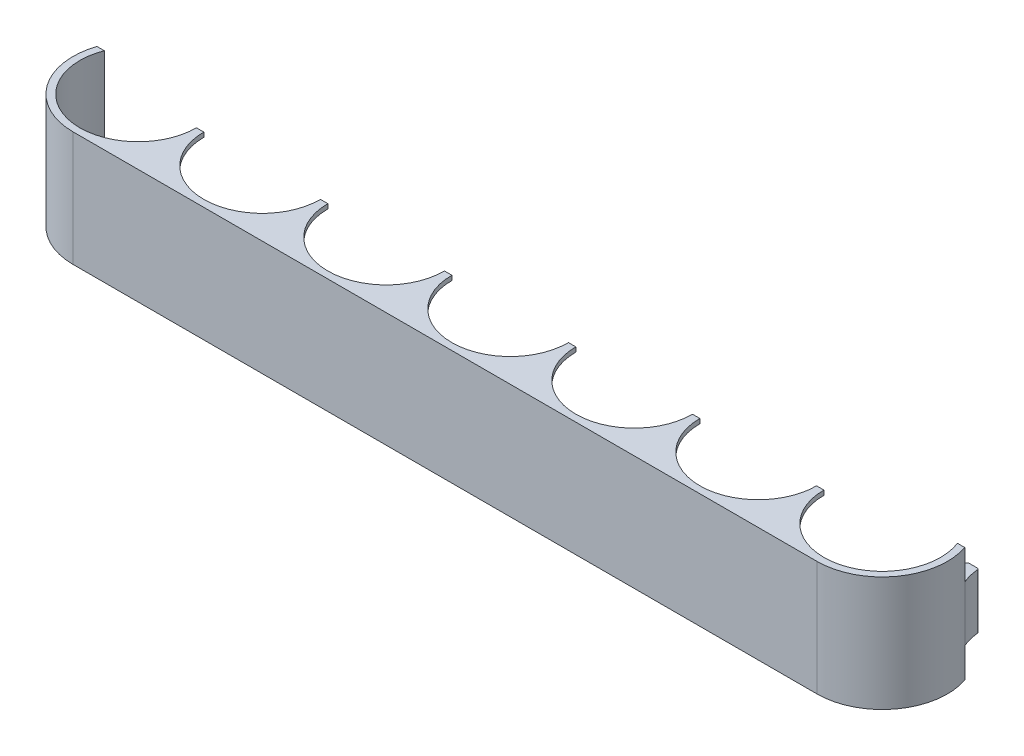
ISO-10303-21;
HEADER;
FILE_DESCRIPTION(('STEP AP214'),'2;1');
FILE_NAME('part.step','',(''),(''),'','','');
FILE_SCHEMA(('AUTOMOTIVE_DESIGN { 1 0 10303 214 1 1 1 1 }'));
ENDSEC;
DATA;
#1=APPLICATION_CONTEXT('core data for automotive mechanical design processes');
#2=APPLICATION_PROTOCOL_DEFINITION('international standard','automotive_design',2000,#1);
#3=PRODUCT_CONTEXT('',#1,'mechanical');
#4=PRODUCT('Part','Part','',(#3));
#5=PRODUCT_RELATED_PRODUCT_CATEGORY('part','',(#4));
#6=PRODUCT_DEFINITION_FORMATION('','',#4);
#7=PRODUCT_DEFINITION_CONTEXT('part definition',#1,'design');
#8=PRODUCT_DEFINITION('design','',#6,#7);
#9=PRODUCT_DEFINITION_SHAPE('','',#8);
#10=(LENGTH_UNIT() NAMED_UNIT(*) SI_UNIT(.MILLI.,.METRE.));
#11=(NAMED_UNIT(*) PLANE_ANGLE_UNIT() SI_UNIT($,.RADIAN.));
#12=(NAMED_UNIT(*) SI_UNIT($,.STERADIAN.) SOLID_ANGLE_UNIT());
#13=UNCERTAINTY_MEASURE_WITH_UNIT(LENGTH_MEASURE(1.E-05),#10,'distance_accuracy_value','');
#14=(GEOMETRIC_REPRESENTATION_CONTEXT(3) GLOBAL_UNCERTAINTY_ASSIGNED_CONTEXT((#13)) GLOBAL_UNIT_ASSIGNED_CONTEXT((#10,
#11,#12)) REPRESENTATION_CONTEXT('',''));
#15=CARTESIAN_POINT('',(0.,0.,0.));
#16=DIRECTION('',(0.,0.,1.));
#17=DIRECTION('',(1.,0.,0.));
#18=AXIS2_PLACEMENT_3D('',#15,#16,#17);
#19=CARTESIAN_POINT('',(-41.,-8.,12.5));
#20=DIRECTION('',(0.,-0.920411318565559,0.390951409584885));
#21=DIRECTION('',(0.,0.390951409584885,0.920411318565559));
#22=AXIS2_PLACEMENT_3D('',#19,#20,#21);
#23=PLANE('',#22);
#24=DIRECTION('',(-1.,0.,0.));
#25=VECTOR('',#24,1.);
#26=CARTESIAN_POINT('',(-41.,-11.5,4.26));
#27=LINE('',#26,#25);
#28=CARTESIAN_POINT('',(-41.,-11.5,4.26));
#29=VERTEX_POINT('',#28);
#30=CARTESIAN_POINT('',(-40.,-11.5,4.26));
#31=VERTEX_POINT('',#30);
#32=EDGE_CURVE('E588',#29,#31,#27,.F.);
#33=ORIENTED_EDGE('',*,*,#32,.F.);
#34=DIRECTION('',(0.,0.390951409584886,0.920411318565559));
#35=VECTOR('',#34,1.);
#36=CARTESIAN_POINT('',(-41.,-11.5,4.26));
#37=LINE('',#36,#35);
#38=CARTESIAN_POINT('',(-41.,-8.,12.5));
#39=VERTEX_POINT('',#38);
#40=EDGE_CURVE('E504',#29,#39,#37,.T.);
#41=ORIENTED_EDGE('',*,*,#40,.T.);
#42=DIRECTION('',(1.,0.,0.));
#43=VECTOR('',#42,1.);
#44=CARTESIAN_POINT('',(-41.,-8.,12.5));
#45=LINE('',#44,#43);
#46=CARTESIAN_POINT('',(-40.,-8.,12.5));
#47=VERTEX_POINT('',#46);
#48=EDGE_CURVE('E495',#39,#47,#45,.T.);
#49=ORIENTED_EDGE('',*,*,#48,.T.);
#50=DIRECTION('',(0.,0.390951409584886,0.920411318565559));
#51=VECTOR('',#50,1.);
#52=CARTESIAN_POINT('',(-40.,-11.5,4.26));
#53=LINE('',#52,#51);
#54=EDGE_CURVE('E501',#31,#47,#53,.T.);
#55=ORIENTED_EDGE('',*,*,#54,.F.);
#56=EDGE_LOOP('',(#33,#41,#49,#55));
#57=FACE_BOUND('',#56,.T.);
#58=ADVANCED_FACE('F14',(#57),#23,.F.);
#59=CARTESIAN_POINT('',(-41.,-11.5,12.5));
#60=DIRECTION('',(0.,0.,-1.));
#61=DIRECTION('',(1.,0.,0.));
#62=AXIS2_PLACEMENT_3D('',#59,#60,#61);
#63=PLANE('',#62);
#64=ORIENTED_EDGE('',*,*,#48,.F.);
#65=DIRECTION('',(0.,1.,0.));
#66=VECTOR('',#65,1.);
#67=CARTESIAN_POINT('',(-41.,0.,12.5));
#68=LINE('',#67,#66);
#69=CARTESIAN_POINT('',(-41.,-11.5,12.5));
#70=VERTEX_POINT('',#69);
#71=EDGE_CURVE('E1026',#39,#70,#68,.F.);
#72=ORIENTED_EDGE('',*,*,#71,.T.);
#73=DIRECTION('',(1.,0.,0.));
#74=VECTOR('',#73,1.);
#75=CARTESIAN_POINT('',(-41.,-11.5,12.5));
#76=LINE('',#75,#74);
#77=CARTESIAN_POINT('',(-40.,-11.5,12.5));
#78=VERTEX_POINT('',#77);
#79=EDGE_CURVE('E506',#78,#70,#76,.F.);
#80=ORIENTED_EDGE('',*,*,#79,.F.);
#81=DIRECTION('',(0.,1.,0.));
#82=VECTOR('',#81,1.);
#83=CARTESIAN_POINT('',(-40.,0.,12.5));
#84=LINE('',#83,#82);
#85=EDGE_CURVE('E511',#47,#78,#84,.F.);
#86=ORIENTED_EDGE('',*,*,#85,.F.);
#87=EDGE_LOOP('',(#64,#72,#80,#86));
#88=FACE_BOUND('',#87,.T.);
#89=ADVANCED_FACE('F515',(#88),#63,.F.);
#90=CARTESIAN_POINT('',(-14.,-8.,12.5));
#91=DIRECTION('',(0.,-0.920411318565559,0.390951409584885));
#92=DIRECTION('',(0.,0.390951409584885,0.920411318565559));
#93=AXIS2_PLACEMENT_3D('',#90,#91,#92);
#94=PLANE('',#93);
#95=DIRECTION('',(-1.,0.,0.));
#96=VECTOR('',#95,1.);
#97=CARTESIAN_POINT('',(-14.,-11.5,4.26));
#98=LINE('',#97,#96);
#99=CARTESIAN_POINT('',(-14.,-11.5,4.26));
#100=VERTEX_POINT('',#99);
#101=CARTESIAN_POINT('',(-13.,-11.5,4.26));
#102=VERTEX_POINT('',#101);
#103=EDGE_CURVE('E505',#100,#102,#98,.F.);
#104=ORIENTED_EDGE('',*,*,#103,.F.);
#105=DIRECTION('',(0.,0.390951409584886,0.920411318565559));
#106=VECTOR('',#105,1.);
#107=CARTESIAN_POINT('',(-14.,-11.5,4.26));
#108=LINE('',#107,#106);
#109=CARTESIAN_POINT('',(-14.,-8.,12.5));
#110=VERTEX_POINT('',#109);
#111=EDGE_CURVE('E1017',#100,#110,#108,.T.);
#112=ORIENTED_EDGE('',*,*,#111,.T.);
#113=DIRECTION('',(1.,0.,0.));
#114=VECTOR('',#113,1.);
#115=CARTESIAN_POINT('',(-14.,-8.,12.5));
#116=LINE('',#115,#114);
#117=CARTESIAN_POINT('',(-13.,-8.,12.5));
#118=VERTEX_POINT('',#117);
#119=EDGE_CURVE('E582',#110,#118,#116,.T.);
#120=ORIENTED_EDGE('',*,*,#119,.T.);
#121=DIRECTION('',(0.,0.390951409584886,0.920411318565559));
#122=VECTOR('',#121,1.);
#123=CARTESIAN_POINT('',(-13.,-11.5,4.26));
#124=LINE('',#123,#122);
#125=EDGE_CURVE('E1020',#102,#118,#124,.T.);
#126=ORIENTED_EDGE('',*,*,#125,.F.);
#127=EDGE_LOOP('',(#104,#112,#120,#126));
#128=FACE_BOUND('',#127,.T.);
#129=ADVANCED_FACE('F2124',(#128),#94,.F.);
#130=CARTESIAN_POINT('',(-14.,-11.5,12.5));
#131=DIRECTION('',(0.,0.,-1.));
#132=DIRECTION('',(1.,0.,0.));
#133=AXIS2_PLACEMENT_3D('',#130,#131,#132);
#134=PLANE('',#133);
#135=ORIENTED_EDGE('',*,*,#119,.F.);
#136=DIRECTION('',(0.,1.,0.));
#137=VECTOR('',#136,1.);
#138=CARTESIAN_POINT('',(-14.,0.,12.5));
#139=LINE('',#138,#137);
#140=CARTESIAN_POINT('',(-14.,-11.5,12.5));
#141=VERTEX_POINT('',#140);
#142=EDGE_CURVE('E1014',#110,#141,#139,.F.);
#143=ORIENTED_EDGE('',*,*,#142,.T.);
#144=DIRECTION('',(1.,0.,0.));
#145=VECTOR('',#144,1.);
#146=CARTESIAN_POINT('',(-14.,-11.5,12.5));
#147=LINE('',#146,#145);
#148=CARTESIAN_POINT('',(-13.,-11.5,12.5));
#149=VERTEX_POINT('',#148);
#150=EDGE_CURVE('E584',#149,#141,#147,.F.);
#151=ORIENTED_EDGE('',*,*,#150,.F.);
#152=DIRECTION('',(0.,1.,0.));
#153=VECTOR('',#152,1.);
#154=CARTESIAN_POINT('',(-13.,0.,12.5));
#155=LINE('',#154,#153);
#156=EDGE_CURVE('E1023',#118,#149,#155,.F.);
#157=ORIENTED_EDGE('',*,*,#156,.F.);
#158=EDGE_LOOP('',(#135,#143,#151,#157));
#159=FACE_BOUND('',#158,.T.);
#160=ADVANCED_FACE('F2115',(#159),#134,.F.);
#161=CARTESIAN_POINT('',(13.,-8.,12.5));
#162=DIRECTION('',(0.,-0.920411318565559,0.390951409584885));
#163=DIRECTION('',(0.,0.390951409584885,0.920411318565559));
#164=AXIS2_PLACEMENT_3D('',#161,#162,#163);
#165=PLANE('',#164);
#166=DIRECTION('',(-1.,0.,0.));
#167=VECTOR('',#166,1.);
#168=CARTESIAN_POINT('',(13.,-11.5,4.26));
#169=LINE('',#168,#167);
#170=CARTESIAN_POINT('',(13.,-11.5,4.26));
#171=VERTEX_POINT('',#170);
#172=CARTESIAN_POINT('',(14.,-11.5,4.26));
#173=VERTEX_POINT('',#172);
#174=EDGE_CURVE('E580',#171,#173,#169,.F.);
#175=ORIENTED_EDGE('',*,*,#174,.F.);
#176=DIRECTION('',(0.,0.390951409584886,0.920411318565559));
#177=VECTOR('',#176,1.);
#178=CARTESIAN_POINT('',(13.,-11.5,4.26));
#179=LINE('',#178,#177);
#180=CARTESIAN_POINT('',(13.,-8.,12.5));
#181=VERTEX_POINT('',#180);
#182=EDGE_CURVE('E1005',#171,#181,#179,.T.);
#183=ORIENTED_EDGE('',*,*,#182,.T.);
#184=DIRECTION('',(1.,0.,0.));
#185=VECTOR('',#184,1.);
#186=CARTESIAN_POINT('',(13.,-8.,12.5));
#187=LINE('',#186,#185);
#188=CARTESIAN_POINT('',(14.,-8.,12.5));
#189=VERTEX_POINT('',#188);
#190=EDGE_CURVE('E576',#181,#189,#187,.T.);
#191=ORIENTED_EDGE('',*,*,#190,.T.);
#192=DIRECTION('',(0.,0.390951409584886,0.920411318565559));
#193=VECTOR('',#192,1.);
#194=CARTESIAN_POINT('',(14.,-11.5,4.26));
#195=LINE('',#194,#193);
#196=EDGE_CURVE('E1008',#173,#189,#195,.T.);
#197=ORIENTED_EDGE('',*,*,#196,.F.);
#198=EDGE_LOOP('',(#175,#183,#191,#197));
#199=FACE_BOUND('',#198,.T.);
#200=ADVANCED_FACE('F2106',(#199),#165,.F.);
#201=CARTESIAN_POINT('',(13.,-11.5,12.5));
#202=DIRECTION('',(0.,0.,-1.));
#203=DIRECTION('',(1.,0.,0.));
#204=AXIS2_PLACEMENT_3D('',#201,#202,#203);
#205=PLANE('',#204);
#206=ORIENTED_EDGE('',*,*,#190,.F.);
#207=DIRECTION('',(0.,1.,0.));
#208=VECTOR('',#207,1.);
#209=CARTESIAN_POINT('',(13.,0.,12.5));
#210=LINE('',#209,#208);
#211=CARTESIAN_POINT('',(13.,-11.5,12.5));
#212=VERTEX_POINT('',#211);
#213=EDGE_CURVE('E1002',#181,#212,#210,.F.);
#214=ORIENTED_EDGE('',*,*,#213,.T.);
#215=DIRECTION('',(1.,0.,0.));
#216=VECTOR('',#215,1.);
#217=CARTESIAN_POINT('',(13.,-11.5,12.5));
#218=LINE('',#217,#216);
#219=CARTESIAN_POINT('',(14.,-11.5,12.5));
#220=VERTEX_POINT('',#219);
#221=EDGE_CURVE('E578',#220,#212,#218,.F.);
#222=ORIENTED_EDGE('',*,*,#221,.F.);
#223=DIRECTION('',(0.,1.,0.));
#224=VECTOR('',#223,1.);
#225=CARTESIAN_POINT('',(14.,0.,12.5));
#226=LINE('',#225,#224);
#227=EDGE_CURVE('E1011',#189,#220,#226,.F.);
#228=ORIENTED_EDGE('',*,*,#227,.F.);
#229=EDGE_LOOP('',(#206,#214,#222,#228));
#230=FACE_BOUND('',#229,.T.);
#231=ADVANCED_FACE('F2097',(#230),#205,.F.);
#232=CARTESIAN_POINT('',(40.,-8.,12.5));
#233=DIRECTION('',(0.,-0.920411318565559,0.390951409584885));
#234=DIRECTION('',(0.,0.390951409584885,0.920411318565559));
#235=AXIS2_PLACEMENT_3D('',#232,#233,#234);
#236=PLANE('',#235);
#237=DIRECTION('',(-1.,0.,0.));
#238=VECTOR('',#237,1.);
#239=CARTESIAN_POINT('',(40.,-11.5,4.26));
#240=LINE('',#239,#238);
#241=CARTESIAN_POINT('',(40.,-11.5,4.26));
#242=VERTEX_POINT('',#241);
#243=CARTESIAN_POINT('',(41.,-11.5,4.26));
#244=VERTEX_POINT('',#243);
#245=EDGE_CURVE('E574',#242,#244,#240,.F.);
#246=ORIENTED_EDGE('',*,*,#245,.F.);
#247=DIRECTION('',(0.,0.390951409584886,0.920411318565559));
#248=VECTOR('',#247,1.);
#249=CARTESIAN_POINT('',(40.,-11.5,4.26));
#250=LINE('',#249,#248);
#251=CARTESIAN_POINT('',(40.,-8.,12.5));
#252=VERTEX_POINT('',#251);
#253=EDGE_CURVE('E993',#242,#252,#250,.T.);
#254=ORIENTED_EDGE('',*,*,#253,.T.);
#255=DIRECTION('',(1.,0.,0.));
#256=VECTOR('',#255,1.);
#257=CARTESIAN_POINT('',(40.,-8.,12.5));
#258=LINE('',#257,#256);
#259=CARTESIAN_POINT('',(41.,-8.,12.5));
#260=VERTEX_POINT('',#259);
#261=EDGE_CURVE('E570',#252,#260,#258,.T.);
#262=ORIENTED_EDGE('',*,*,#261,.T.);
#263=DIRECTION('',(0.,0.390951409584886,0.920411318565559));
#264=VECTOR('',#263,1.);
#265=CARTESIAN_POINT('',(41.,-11.5,4.26));
#266=LINE('',#265,#264);
#267=EDGE_CURVE('E996',#244,#260,#266,.T.);
#268=ORIENTED_EDGE('',*,*,#267,.F.);
#269=EDGE_LOOP('',(#246,#254,#262,#268));
#270=FACE_BOUND('',#269,.T.);
#271=ADVANCED_FACE('F2088',(#270),#236,.F.);
#272=CARTESIAN_POINT('',(40.,-11.5,12.5));
#273=DIRECTION('',(0.,0.,-1.));
#274=DIRECTION('',(1.,0.,0.));
#275=AXIS2_PLACEMENT_3D('',#272,#273,#274);
#276=PLANE('',#275);
#277=ORIENTED_EDGE('',*,*,#261,.F.);
#278=DIRECTION('',(0.,1.,0.));
#279=VECTOR('',#278,1.);
#280=CARTESIAN_POINT('',(40.,0.,12.5));
#281=LINE('',#280,#279);
#282=CARTESIAN_POINT('',(40.,-11.5,12.5));
#283=VERTEX_POINT('',#282);
#284=EDGE_CURVE('E990',#252,#283,#281,.F.);
#285=ORIENTED_EDGE('',*,*,#284,.T.);
#286=DIRECTION('',(1.,0.,0.));
#287=VECTOR('',#286,1.);
#288=CARTESIAN_POINT('',(40.,-11.5,12.5));
#289=LINE('',#288,#287);
#290=CARTESIAN_POINT('',(41.,-11.5,12.5));
#291=VERTEX_POINT('',#290);
#292=EDGE_CURVE('E572',#291,#283,#289,.F.);
#293=ORIENTED_EDGE('',*,*,#292,.F.);
#294=DIRECTION('',(0.,1.,0.));
#295=VECTOR('',#294,1.);
#296=CARTESIAN_POINT('',(41.,0.,12.5));
#297=LINE('',#296,#295);
#298=EDGE_CURVE('E999',#260,#291,#297,.F.);
#299=ORIENTED_EDGE('',*,*,#298,.F.);
#300=EDGE_LOOP('',(#277,#285,#293,#299));
#301=FACE_BOUND('',#300,.T.);
#302=ADVANCED_FACE('F2079',(#301),#276,.F.);
#303=CARTESIAN_POINT('',(-68.,-8.,12.5));
#304=DIRECTION('',(0.,-0.920411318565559,0.390951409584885));
#305=DIRECTION('',(0.,0.390951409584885,0.920411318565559));
#306=AXIS2_PLACEMENT_3D('',#303,#304,#305);
#307=PLANE('',#306);
#308=DIRECTION('',(-1.,0.,0.));
#309=VECTOR('',#308,1.);
#310=CARTESIAN_POINT('',(-68.,-11.5,4.26));
#311=LINE('',#310,#309);
#312=CARTESIAN_POINT('',(-68.,-11.5,4.26));
#313=VERTEX_POINT('',#312);
#314=CARTESIAN_POINT('',(-67.,-11.5,4.26));
#315=VERTEX_POINT('',#314);
#316=EDGE_CURVE('E568',#313,#315,#311,.F.);
#317=ORIENTED_EDGE('',*,*,#316,.F.);
#318=DIRECTION('',(0.,0.390951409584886,0.920411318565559));
#319=VECTOR('',#318,1.);
#320=CARTESIAN_POINT('',(-68.,-11.5,4.26));
#321=LINE('',#320,#319);
#322=CARTESIAN_POINT('',(-68.,-8.,12.5));
#323=VERTEX_POINT('',#322);
#324=EDGE_CURVE('E981',#313,#323,#321,.T.);
#325=ORIENTED_EDGE('',*,*,#324,.T.);
#326=DIRECTION('',(1.,0.,0.));
#327=VECTOR('',#326,1.);
#328=CARTESIAN_POINT('',(-68.,-8.,12.5));
#329=LINE('',#328,#327);
#330=CARTESIAN_POINT('',(-67.,-8.,12.5));
#331=VERTEX_POINT('',#330);
#332=EDGE_CURVE('E564',#323,#331,#329,.T.);
#333=ORIENTED_EDGE('',*,*,#332,.T.);
#334=DIRECTION('',(0.,0.390951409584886,0.920411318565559));
#335=VECTOR('',#334,1.);
#336=CARTESIAN_POINT('',(-67.,-11.5,4.26));
#337=LINE('',#336,#335);
#338=EDGE_CURVE('E984',#315,#331,#337,.T.);
#339=ORIENTED_EDGE('',*,*,#338,.F.);
#340=EDGE_LOOP('',(#317,#325,#333,#339));
#341=FACE_BOUND('',#340,.T.);
#342=ADVANCED_FACE('F2070',(#341),#307,.F.);
#343=CARTESIAN_POINT('',(-68.,-11.5,12.5));
#344=DIRECTION('',(0.,0.,-1.));
#345=DIRECTION('',(1.,0.,0.));
#346=AXIS2_PLACEMENT_3D('',#343,#344,#345);
#347=PLANE('',#346);
#348=ORIENTED_EDGE('',*,*,#332,.F.);
#349=DIRECTION('',(0.,1.,0.));
#350=VECTOR('',#349,1.);
#351=CARTESIAN_POINT('',(-68.,0.,12.5));
#352=LINE('',#351,#350);
#353=CARTESIAN_POINT('',(-68.,-11.5,12.5));
#354=VERTEX_POINT('',#353);
#355=EDGE_CURVE('E978',#323,#354,#352,.F.);
#356=ORIENTED_EDGE('',*,*,#355,.T.);
#357=DIRECTION('',(1.,0.,0.));
#358=VECTOR('',#357,1.);
#359=CARTESIAN_POINT('',(-68.,-11.5,12.5));
#360=LINE('',#359,#358);
#361=CARTESIAN_POINT('',(-67.,-11.5,12.5));
#362=VERTEX_POINT('',#361);
#363=EDGE_CURVE('E566',#362,#354,#360,.F.);
#364=ORIENTED_EDGE('',*,*,#363,.F.);
#365=DIRECTION('',(0.,1.,0.));
#366=VECTOR('',#365,1.);
#367=CARTESIAN_POINT('',(-67.,0.,12.5));
#368=LINE('',#367,#366);
#369=EDGE_CURVE('E987',#331,#362,#368,.F.);
#370=ORIENTED_EDGE('',*,*,#369,.F.);
#371=EDGE_LOOP('',(#348,#356,#364,#370));
#372=FACE_BOUND('',#371,.T.);
#373=ADVANCED_FACE('F2061',(#372),#347,.F.);
#374=CARTESIAN_POINT('',(-68.,11.5,4.26));
#375=DIRECTION('',(0.,0.920411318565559,0.390951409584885));
#376=DIRECTION('',(0.,0.390951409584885,-0.920411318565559));
#377=AXIS2_PLACEMENT_3D('',#374,#375,#376);
#378=PLANE('',#377);
#379=DIRECTION('',(1.,0.,0.));
#380=VECTOR('',#379,1.);
#381=CARTESIAN_POINT('',(-68.,8.,12.5));
#382=LINE('',#381,#380);
#383=CARTESIAN_POINT('',(-67.,8.,12.5));
#384=VERTEX_POINT('',#383);
#385=CARTESIAN_POINT('',(-68.,8.,12.5));
#386=VERTEX_POINT('',#385);
#387=EDGE_CURVE('E560',#384,#386,#382,.F.);
#388=ORIENTED_EDGE('',*,*,#387,.T.);
#389=DIRECTION('',(0.,-0.390951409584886,0.920411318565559));
#390=VECTOR('',#389,1.);
#391=CARTESIAN_POINT('',(-68.,11.5,4.26));
#392=LINE('',#391,#390);
#393=CARTESIAN_POINT('',(-68.,11.5,4.26));
#394=VERTEX_POINT('',#393);
#395=EDGE_CURVE('E972',#394,#386,#392,.T.);
#396=ORIENTED_EDGE('',*,*,#395,.F.);
#397=DIRECTION('',(-1.,0.,0.));
#398=VECTOR('',#397,1.);
#399=CARTESIAN_POINT('',(-68.,11.5,4.26));
#400=LINE('',#399,#398);
#401=CARTESIAN_POINT('',(-67.,11.5,4.26));
#402=VERTEX_POINT('',#401);
#403=EDGE_CURVE('E562',#402,#394,#400,.T.);
#404=ORIENTED_EDGE('',*,*,#403,.F.);
#405=DIRECTION('',(0.,-0.390951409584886,0.920411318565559));
#406=VECTOR('',#405,1.);
#407=CARTESIAN_POINT('',(-67.,11.5,4.26));
#408=LINE('',#407,#406);
#409=EDGE_CURVE('E969',#402,#384,#408,.T.);
#410=ORIENTED_EDGE('',*,*,#409,.T.);
#411=EDGE_LOOP('',(#388,#396,#404,#410));
#412=FACE_BOUND('',#411,.T.);
#413=ADVANCED_FACE('F2052',(#412),#378,.F.);
#414=CARTESIAN_POINT('',(-68.,8.,12.5));
#415=DIRECTION('',(0.,0.,-1.));
#416=DIRECTION('',(1.,0.,0.));
#417=AXIS2_PLACEMENT_3D('',#414,#415,#416);
#418=PLANE('',#417);
#419=DIRECTION('',(1.,0.,0.));
#420=VECTOR('',#419,1.);
#421=CARTESIAN_POINT('',(-68.,11.5,12.5));
#422=LINE('',#421,#420);
#423=CARTESIAN_POINT('',(-68.,11.5,12.5));
#424=VERTEX_POINT('',#423);
#425=CARTESIAN_POINT('',(-67.,11.5,12.5));
#426=VERTEX_POINT('',#425);
#427=EDGE_CURVE('E558',#424,#426,#422,.T.);
#428=ORIENTED_EDGE('',*,*,#427,.F.);
#429=DIRECTION('',(0.,-1.,0.));
#430=VECTOR('',#429,1.);
#431=CARTESIAN_POINT('',(-68.,0.,12.5));
#432=LINE('',#431,#430);
#433=EDGE_CURVE('E975',#386,#424,#432,.F.);
#434=ORIENTED_EDGE('',*,*,#433,.F.);
#435=ORIENTED_EDGE('',*,*,#387,.F.);
#436=DIRECTION('',(0.,-1.,0.));
#437=VECTOR('',#436,1.);
#438=CARTESIAN_POINT('',(-67.,0.,12.5));
#439=LINE('',#438,#437);
#440=EDGE_CURVE('E966',#384,#426,#439,.F.);
#441=ORIENTED_EDGE('',*,*,#440,.T.);
#442=EDGE_LOOP('',(#428,#434,#435,#441));
#443=FACE_BOUND('',#442,.T.);
#444=ADVANCED_FACE('F2043',(#443),#418,.F.);
#445=CARTESIAN_POINT('',(-41.,11.5,4.26));
#446=DIRECTION('',(0.,0.920411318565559,0.390951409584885));
#447=DIRECTION('',(0.,0.390951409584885,-0.920411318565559));
#448=AXIS2_PLACEMENT_3D('',#445,#446,#447);
#449=PLANE('',#448);
#450=DIRECTION('',(1.,0.,0.));
#451=VECTOR('',#450,1.);
#452=CARTESIAN_POINT('',(-41.,8.,12.5));
#453=LINE('',#452,#451);
#454=CARTESIAN_POINT('',(-40.,8.,12.5));
#455=VERTEX_POINT('',#454);
#456=CARTESIAN_POINT('',(-41.,8.,12.5));
#457=VERTEX_POINT('',#456);
#458=EDGE_CURVE('E554',#455,#457,#453,.F.);
#459=ORIENTED_EDGE('',*,*,#458,.T.);
#460=DIRECTION('',(0.,-0.390951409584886,0.920411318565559));
#461=VECTOR('',#460,1.);
#462=CARTESIAN_POINT('',(-41.,11.5,4.26));
#463=LINE('',#462,#461);
#464=CARTESIAN_POINT('',(-41.,11.5,4.26));
#465=VERTEX_POINT('',#464);
#466=EDGE_CURVE('E960',#465,#457,#463,.T.);
#467=ORIENTED_EDGE('',*,*,#466,.F.);
#468=DIRECTION('',(-1.,0.,0.));
#469=VECTOR('',#468,1.);
#470=CARTESIAN_POINT('',(-41.,11.5,4.26));
#471=LINE('',#470,#469);
#472=CARTESIAN_POINT('',(-40.,11.5,4.26));
#473=VERTEX_POINT('',#472);
#474=EDGE_CURVE('E556',#473,#465,#471,.T.);
#475=ORIENTED_EDGE('',*,*,#474,.F.);
#476=DIRECTION('',(0.,-0.390951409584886,0.920411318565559));
#477=VECTOR('',#476,1.);
#478=CARTESIAN_POINT('',(-40.,11.5,4.26));
#479=LINE('',#478,#477);
#480=EDGE_CURVE('E957',#473,#455,#479,.T.);
#481=ORIENTED_EDGE('',*,*,#480,.T.);
#482=EDGE_LOOP('',(#459,#467,#475,#481));
#483=FACE_BOUND('',#482,.T.);
#484=ADVANCED_FACE('F2034',(#483),#449,.F.);
#485=CARTESIAN_POINT('',(-41.,8.,12.5));
#486=DIRECTION('',(0.,0.,-1.));
#487=DIRECTION('',(1.,0.,0.));
#488=AXIS2_PLACEMENT_3D('',#485,#486,#487);
#489=PLANE('',#488);
#490=DIRECTION('',(1.,0.,0.));
#491=VECTOR('',#490,1.);
#492=CARTESIAN_POINT('',(-41.,11.5,12.5));
#493=LINE('',#492,#491);
#494=CARTESIAN_POINT('',(-41.,11.5,12.5));
#495=VERTEX_POINT('',#494);
#496=CARTESIAN_POINT('',(-40.,11.5,12.5));
#497=VERTEX_POINT('',#496);
#498=EDGE_CURVE('E552',#495,#497,#493,.T.);
#499=ORIENTED_EDGE('',*,*,#498,.F.);
#500=DIRECTION('',(0.,-1.,0.));
#501=VECTOR('',#500,1.);
#502=CARTESIAN_POINT('',(-41.,0.,12.5));
#503=LINE('',#502,#501);
#504=EDGE_CURVE('E963',#457,#495,#503,.F.);
#505=ORIENTED_EDGE('',*,*,#504,.F.);
#506=ORIENTED_EDGE('',*,*,#458,.F.);
#507=DIRECTION('',(0.,-1.,0.));
#508=VECTOR('',#507,1.);
#509=CARTESIAN_POINT('',(-40.,0.,12.5));
#510=LINE('',#509,#508);
#511=EDGE_CURVE('E954',#455,#497,#510,.F.);
#512=ORIENTED_EDGE('',*,*,#511,.T.);
#513=EDGE_LOOP('',(#499,#505,#506,#512));
#514=FACE_BOUND('',#513,.T.);
#515=ADVANCED_FACE('F2025',(#514),#489,.F.);
#516=CARTESIAN_POINT('',(-14.,11.5,4.26));
#517=DIRECTION('',(0.,0.920411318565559,0.390951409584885));
#518=DIRECTION('',(0.,0.390951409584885,-0.920411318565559));
#519=AXIS2_PLACEMENT_3D('',#516,#517,#518);
#520=PLANE('',#519);
#521=DIRECTION('',(1.,0.,0.));
#522=VECTOR('',#521,1.);
#523=CARTESIAN_POINT('',(-14.,8.,12.5));
#524=LINE('',#523,#522);
#525=CARTESIAN_POINT('',(-13.,8.,12.5));
#526=VERTEX_POINT('',#525);
#527=CARTESIAN_POINT('',(-14.,8.,12.5));
#528=VERTEX_POINT('',#527);
#529=EDGE_CURVE('E548',#526,#528,#524,.F.);
#530=ORIENTED_EDGE('',*,*,#529,.T.);
#531=DIRECTION('',(0.,-0.390951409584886,0.920411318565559));
#532=VECTOR('',#531,1.);
#533=CARTESIAN_POINT('',(-14.,11.5,4.26));
#534=LINE('',#533,#532);
#535=CARTESIAN_POINT('',(-14.,11.5,4.26));
#536=VERTEX_POINT('',#535);
#537=EDGE_CURVE('E948',#536,#528,#534,.T.);
#538=ORIENTED_EDGE('',*,*,#537,.F.);
#539=DIRECTION('',(-1.,0.,0.));
#540=VECTOR('',#539,1.);
#541=CARTESIAN_POINT('',(-14.,11.5,4.26));
#542=LINE('',#541,#540);
#543=CARTESIAN_POINT('',(-13.,11.5,4.26));
#544=VERTEX_POINT('',#543);
#545=EDGE_CURVE('E550',#544,#536,#542,.T.);
#546=ORIENTED_EDGE('',*,*,#545,.F.);
#547=DIRECTION('',(0.,-0.390951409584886,0.920411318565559));
#548=VECTOR('',#547,1.);
#549=CARTESIAN_POINT('',(-13.,11.5,4.26));
#550=LINE('',#549,#548);
#551=EDGE_CURVE('E945',#544,#526,#550,.T.);
#552=ORIENTED_EDGE('',*,*,#551,.T.);
#553=EDGE_LOOP('',(#530,#538,#546,#552));
#554=FACE_BOUND('',#553,.T.);
#555=ADVANCED_FACE('F2016',(#554),#520,.F.);
#556=CARTESIAN_POINT('',(-14.,8.,12.5));
#557=DIRECTION('',(0.,0.,-1.));
#558=DIRECTION('',(1.,0.,0.));
#559=AXIS2_PLACEMENT_3D('',#556,#557,#558);
#560=PLANE('',#559);
#561=DIRECTION('',(1.,0.,0.));
#562=VECTOR('',#561,1.);
#563=CARTESIAN_POINT('',(-14.,11.5,12.5));
#564=LINE('',#563,#562);
#565=CARTESIAN_POINT('',(-14.,11.5,12.5));
#566=VERTEX_POINT('',#565);
#567=CARTESIAN_POINT('',(-13.,11.5,12.5));
#568=VERTEX_POINT('',#567);
#569=EDGE_CURVE('E546',#566,#568,#564,.T.);
#570=ORIENTED_EDGE('',*,*,#569,.F.);
#571=DIRECTION('',(0.,-1.,0.));
#572=VECTOR('',#571,1.);
#573=CARTESIAN_POINT('',(-14.,0.,12.5));
#574=LINE('',#573,#572);
#575=EDGE_CURVE('E951',#528,#566,#574,.F.);
#576=ORIENTED_EDGE('',*,*,#575,.F.);
#577=ORIENTED_EDGE('',*,*,#529,.F.);
#578=DIRECTION('',(0.,-1.,0.));
#579=VECTOR('',#578,1.);
#580=CARTESIAN_POINT('',(-13.,0.,12.5));
#581=LINE('',#580,#579);
#582=EDGE_CURVE('E942',#526,#568,#581,.F.);
#583=ORIENTED_EDGE('',*,*,#582,.T.);
#584=EDGE_LOOP('',(#570,#576,#577,#583));
#585=FACE_BOUND('',#584,.T.);
#586=ADVANCED_FACE('F2007',(#585),#560,.F.);
#587=CARTESIAN_POINT('',(13.,11.5,4.26));
#588=DIRECTION('',(0.,0.920411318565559,0.390951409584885));
#589=DIRECTION('',(0.,0.390951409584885,-0.920411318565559));
#590=AXIS2_PLACEMENT_3D('',#587,#588,#589);
#591=PLANE('',#590);
#592=DIRECTION('',(1.,0.,0.));
#593=VECTOR('',#592,1.);
#594=CARTESIAN_POINT('',(13.,8.,12.5));
#595=LINE('',#594,#593);
#596=CARTESIAN_POINT('',(14.,8.,12.5));
#597=VERTEX_POINT('',#596);
#598=CARTESIAN_POINT('',(13.,8.,12.5));
#599=VERTEX_POINT('',#598);
#600=EDGE_CURVE('E542',#597,#599,#595,.F.);
#601=ORIENTED_EDGE('',*,*,#600,.T.);
#602=DIRECTION('',(0.,-0.390951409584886,0.920411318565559));
#603=VECTOR('',#602,1.);
#604=CARTESIAN_POINT('',(13.,11.5,4.26));
#605=LINE('',#604,#603);
#606=CARTESIAN_POINT('',(13.,11.5,4.26));
#607=VERTEX_POINT('',#606);
#608=EDGE_CURVE('E936',#607,#599,#605,.T.);
#609=ORIENTED_EDGE('',*,*,#608,.F.);
#610=DIRECTION('',(-1.,0.,0.));
#611=VECTOR('',#610,1.);
#612=CARTESIAN_POINT('',(13.,11.5,4.26));
#613=LINE('',#612,#611);
#614=CARTESIAN_POINT('',(14.,11.5,4.26));
#615=VERTEX_POINT('',#614);
#616=EDGE_CURVE('E544',#615,#607,#613,.T.);
#617=ORIENTED_EDGE('',*,*,#616,.F.);
#618=DIRECTION('',(0.,-0.390951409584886,0.920411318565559));
#619=VECTOR('',#618,1.);
#620=CARTESIAN_POINT('',(14.,11.5,4.26));
#621=LINE('',#620,#619);
#622=EDGE_CURVE('E933',#615,#597,#621,.T.);
#623=ORIENTED_EDGE('',*,*,#622,.T.);
#624=EDGE_LOOP('',(#601,#609,#617,#623));
#625=FACE_BOUND('',#624,.T.);
#626=ADVANCED_FACE('F1998',(#625),#591,.F.);
#627=CARTESIAN_POINT('',(13.,8.,12.5));
#628=DIRECTION('',(0.,0.,-1.));
#629=DIRECTION('',(1.,0.,0.));
#630=AXIS2_PLACEMENT_3D('',#627,#628,#629);
#631=PLANE('',#630);
#632=DIRECTION('',(1.,0.,0.));
#633=VECTOR('',#632,1.);
#634=CARTESIAN_POINT('',(13.,11.5,12.5));
#635=LINE('',#634,#633);
#636=CARTESIAN_POINT('',(13.,11.5,12.5));
#637=VERTEX_POINT('',#636);
#638=CARTESIAN_POINT('',(14.,11.5,12.5));
#639=VERTEX_POINT('',#638);
#640=EDGE_CURVE('E540',#637,#639,#635,.T.);
#641=ORIENTED_EDGE('',*,*,#640,.F.);
#642=DIRECTION('',(0.,-1.,0.));
#643=VECTOR('',#642,1.);
#644=CARTESIAN_POINT('',(13.,0.,12.5));
#645=LINE('',#644,#643);
#646=EDGE_CURVE('E939',#599,#637,#645,.F.);
#647=ORIENTED_EDGE('',*,*,#646,.F.);
#648=ORIENTED_EDGE('',*,*,#600,.F.);
#649=DIRECTION('',(0.,-1.,0.));
#650=VECTOR('',#649,1.);
#651=CARTESIAN_POINT('',(14.,0.,12.5));
#652=LINE('',#651,#650);
#653=EDGE_CURVE('E930',#597,#639,#652,.F.);
#654=ORIENTED_EDGE('',*,*,#653,.T.);
#655=EDGE_LOOP('',(#641,#647,#648,#654));
#656=FACE_BOUND('',#655,.T.);
#657=ADVANCED_FACE('F1990',(#656),#631,.F.);
#658=CARTESIAN_POINT('',(40.,11.5,4.26));
#659=DIRECTION('',(0.,0.920411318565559,0.390951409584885));
#660=DIRECTION('',(0.,0.390951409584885,-0.920411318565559));
#661=AXIS2_PLACEMENT_3D('',#658,#659,#660);
#662=PLANE('',#661);
#663=DIRECTION('',(1.,0.,0.));
#664=VECTOR('',#663,1.);
#665=CARTESIAN_POINT('',(40.,8.,12.5));
#666=LINE('',#665,#664);
#667=CARTESIAN_POINT('',(41.,8.,12.5));
#668=VERTEX_POINT('',#667);
#669=CARTESIAN_POINT('',(40.,8.,12.5));
#670=VERTEX_POINT('',#669);
#671=EDGE_CURVE('E537',#668,#670,#666,.F.);
#672=ORIENTED_EDGE('',*,*,#671,.T.);
#673=DIRECTION('',(0.,-0.390951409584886,0.920411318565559));
#674=VECTOR('',#673,1.);
#675=CARTESIAN_POINT('',(40.,11.5,4.26));
#676=LINE('',#675,#674);
#677=CARTESIAN_POINT('',(40.,11.5,4.26));
#678=VERTEX_POINT('',#677);
#679=EDGE_CURVE('E924',#678,#670,#676,.T.);
#680=ORIENTED_EDGE('',*,*,#679,.F.);
#681=DIRECTION('',(-1.,0.,0.));
#682=VECTOR('',#681,1.);
#683=CARTESIAN_POINT('',(40.,11.5,4.26));
#684=LINE('',#683,#682);
#685=CARTESIAN_POINT('',(41.,11.5,4.26));
#686=VERTEX_POINT('',#685);
#687=EDGE_CURVE('E303',#686,#678,#684,.T.);
#688=ORIENTED_EDGE('',*,*,#687,.F.);
#689=DIRECTION('',(0.,-0.390951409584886,0.920411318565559));
#690=VECTOR('',#689,1.);
#691=CARTESIAN_POINT('',(41.,11.5,4.26));
#692=LINE('',#691,#690);
#693=EDGE_CURVE('E922',#686,#668,#692,.T.);
#694=ORIENTED_EDGE('',*,*,#693,.T.);
#695=EDGE_LOOP('',(#672,#680,#688,#694));
#696=FACE_BOUND('',#695,.T.);
#697=ADVANCED_FACE('F1981',(#696),#662,.F.);
#698=CARTESIAN_POINT('',(40.,8.,12.5));
#699=DIRECTION('',(0.,0.,-1.));
#700=DIRECTION('',(1.,0.,0.));
#701=AXIS2_PLACEMENT_3D('',#698,#699,#700);
#702=PLANE('',#701);
#703=DIRECTION('',(1.,0.,0.));
#704=VECTOR('',#703,1.);
#705=CARTESIAN_POINT('',(40.,11.5,12.5));
#706=LINE('',#705,#704);
#707=CARTESIAN_POINT('',(40.,11.5,12.5));
#708=VERTEX_POINT('',#707);
#709=CARTESIAN_POINT('',(41.,11.5,12.5));
#710=VERTEX_POINT('',#709);
#711=EDGE_CURVE('E535',#708,#710,#706,.T.);
#712=ORIENTED_EDGE('',*,*,#711,.F.);
#713=DIRECTION('',(0.,-1.,0.));
#714=VECTOR('',#713,1.);
#715=CARTESIAN_POINT('',(40.,0.,12.5));
#716=LINE('',#715,#714);
#717=EDGE_CURVE('E927',#670,#708,#716,.F.);
#718=ORIENTED_EDGE('',*,*,#717,.F.);
#719=ORIENTED_EDGE('',*,*,#671,.F.);
#720=DIRECTION('',(0.,-1.,0.));
#721=VECTOR('',#720,1.);
#722=CARTESIAN_POINT('',(41.,0.,12.5));
#723=LINE('',#722,#721);
#724=EDGE_CURVE('E919',#668,#710,#723,.F.);
#725=ORIENTED_EDGE('',*,*,#724,.T.);
#726=EDGE_LOOP('',(#712,#718,#719,#725));
#727=FACE_BOUND('',#726,.T.);
#728=ADVANCED_FACE('F1972',(#727),#702,.F.);
#729=CARTESIAN_POINT('',(67.,11.5,4.26));
#730=DIRECTION('',(0.,0.920411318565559,0.390951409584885));
#731=DIRECTION('',(0.,0.390951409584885,-0.920411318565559));
#732=AXIS2_PLACEMENT_3D('',#729,#730,#731);
#733=PLANE('',#732);
#734=DIRECTION('',(1.,0.,0.));
#735=VECTOR('',#734,1.);
#736=CARTESIAN_POINT('',(67.,8.,12.5));
#737=LINE('',#736,#735);
#738=CARTESIAN_POINT('',(68.,8.,12.5));
#739=VERTEX_POINT('',#738);
#740=CARTESIAN_POINT('',(67.,8.,12.5));
#741=VERTEX_POINT('',#740);
#742=EDGE_CURVE('E530',#739,#741,#737,.F.);
#743=ORIENTED_EDGE('',*,*,#742,.T.);
#744=DIRECTION('',(0.,-0.390951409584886,0.920411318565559));
#745=VECTOR('',#744,1.);
#746=CARTESIAN_POINT('',(67.,11.5,4.26));
#747=LINE('',#746,#745);
#748=CARTESIAN_POINT('',(67.,11.5,4.26));
#749=VERTEX_POINT('',#748);
#750=EDGE_CURVE('E909',#749,#741,#747,.T.);
#751=ORIENTED_EDGE('',*,*,#750,.F.);
#752=DIRECTION('',(-1.,0.,0.));
#753=VECTOR('',#752,1.);
#754=CARTESIAN_POINT('',(67.,11.5,4.26));
#755=LINE('',#754,#753);
#756=CARTESIAN_POINT('',(68.,11.5,4.26));
#757=VERTEX_POINT('',#756);
#758=EDGE_CURVE('E532',#757,#749,#755,.T.);
#759=ORIENTED_EDGE('',*,*,#758,.F.);
#760=DIRECTION('',(0.,-0.390951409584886,0.920411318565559));
#761=VECTOR('',#760,1.);
#762=CARTESIAN_POINT('',(68.,11.5,4.26));
#763=LINE('',#762,#761);
#764=EDGE_CURVE('E906',#757,#739,#763,.T.);
#765=ORIENTED_EDGE('',*,*,#764,.T.);
#766=EDGE_LOOP('',(#743,#751,#759,#765));
#767=FACE_BOUND('',#766,.T.);
#768=ADVANCED_FACE('F1963',(#767),#733,.F.);
#769=CARTESIAN_POINT('',(67.,8.,12.5));
#770=DIRECTION('',(0.,0.,-1.));
#771=DIRECTION('',(1.,0.,0.));
#772=AXIS2_PLACEMENT_3D('',#769,#770,#771);
#773=PLANE('',#772);
#774=DIRECTION('',(1.,0.,0.));
#775=VECTOR('',#774,1.);
#776=CARTESIAN_POINT('',(67.,11.5,12.5));
#777=LINE('',#776,#775);
#778=CARTESIAN_POINT('',(67.,11.5,12.5));
#779=VERTEX_POINT('',#778);
#780=CARTESIAN_POINT('',(68.,11.5,12.5));
#781=VERTEX_POINT('',#780);
#782=EDGE_CURVE('E527',#779,#781,#777,.T.);
#783=ORIENTED_EDGE('',*,*,#782,.F.);
#784=DIRECTION('',(0.,-1.,0.));
#785=VECTOR('',#784,1.);
#786=CARTESIAN_POINT('',(67.,0.,12.5));
#787=LINE('',#786,#785);
#788=EDGE_CURVE('E912',#741,#779,#787,.F.);
#789=ORIENTED_EDGE('',*,*,#788,.F.);
#790=ORIENTED_EDGE('',*,*,#742,.F.);
#791=DIRECTION('',(0.,-1.,0.));
#792=VECTOR('',#791,1.);
#793=CARTESIAN_POINT('',(68.,0.,12.5));
#794=LINE('',#793,#792);
#795=EDGE_CURVE('E886',#739,#781,#794,.F.);
#796=ORIENTED_EDGE('',*,*,#795,.T.);
#797=EDGE_LOOP('',(#783,#789,#790,#796));
#798=FACE_BOUND('',#797,.T.);
#799=ADVANCED_FACE('F1954',(#798),#773,.F.);
#800=CARTESIAN_POINT('',(67.,-8.,12.5));
#801=DIRECTION('',(0.,-0.920411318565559,0.390951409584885));
#802=DIRECTION('',(0.,0.390951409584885,0.920411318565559));
#803=AXIS2_PLACEMENT_3D('',#800,#801,#802);
#804=PLANE('',#803);
#805=DIRECTION('',(-1.,0.,0.));
#806=VECTOR('',#805,1.);
#807=CARTESIAN_POINT('',(67.,-11.5,4.26));
#808=LINE('',#807,#806);
#809=CARTESIAN_POINT('',(67.,-11.5,4.26));
#810=VERTEX_POINT('',#809);
#811=CARTESIAN_POINT('',(68.,-11.5,4.26));
#812=VERTEX_POINT('',#811);
#813=EDGE_CURVE('E524',#810,#812,#808,.F.);
#814=ORIENTED_EDGE('',*,*,#813,.F.);
#815=DIRECTION('',(0.,0.390951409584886,0.920411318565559));
#816=VECTOR('',#815,1.);
#817=CARTESIAN_POINT('',(67.,-11.5,4.26));
#818=LINE('',#817,#816);
#819=CARTESIAN_POINT('',(67.,-8.,12.5));
#820=VERTEX_POINT('',#819);
#821=EDGE_CURVE('E877',#810,#820,#818,.T.);
#822=ORIENTED_EDGE('',*,*,#821,.T.);
#823=DIRECTION('',(1.,0.,0.));
#824=VECTOR('',#823,1.);
#825=CARTESIAN_POINT('',(67.,-8.,12.5));
#826=LINE('',#825,#824);
#827=CARTESIAN_POINT('',(68.,-8.,12.5));
#828=VERTEX_POINT('',#827);
#829=EDGE_CURVE('E516',#820,#828,#826,.T.);
#830=ORIENTED_EDGE('',*,*,#829,.T.);
#831=DIRECTION('',(0.,0.390951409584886,0.920411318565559));
#832=VECTOR('',#831,1.);
#833=CARTESIAN_POINT('',(68.,-11.5,4.26));
#834=LINE('',#833,#832);
#835=EDGE_CURVE('E880',#812,#828,#834,.T.);
#836=ORIENTED_EDGE('',*,*,#835,.F.);
#837=EDGE_LOOP('',(#814,#822,#830,#836));
#838=FACE_BOUND('',#837,.T.);
#839=ADVANCED_FACE('F1945',(#838),#804,.F.);
#840=CARTESIAN_POINT('',(67.,-11.5,12.5));
#841=DIRECTION('',(0.,0.,-1.));
#842=DIRECTION('',(1.,0.,0.));
#843=AXIS2_PLACEMENT_3D('',#840,#841,#842);
#844=PLANE('',#843);
#845=ORIENTED_EDGE('',*,*,#829,.F.);
#846=DIRECTION('',(0.,1.,0.));
#847=VECTOR('',#846,1.);
#848=CARTESIAN_POINT('',(67.,0.,12.5));
#849=LINE('',#848,#847);
#850=CARTESIAN_POINT('',(67.,-11.5,12.5));
#851=VERTEX_POINT('',#850);
#852=EDGE_CURVE('E874',#820,#851,#849,.F.);
#853=ORIENTED_EDGE('',*,*,#852,.T.);
#854=DIRECTION('',(1.,0.,0.));
#855=VECTOR('',#854,1.);
#856=CARTESIAN_POINT('',(67.,-11.5,12.5));
#857=LINE('',#856,#855);
#858=CARTESIAN_POINT('',(68.,-11.5,12.5));
#859=VERTEX_POINT('',#858);
#860=EDGE_CURVE('E518',#859,#851,#857,.F.);
#861=ORIENTED_EDGE('',*,*,#860,.F.);
#862=DIRECTION('',(0.,1.,0.));
#863=VECTOR('',#862,1.);
#864=CARTESIAN_POINT('',(68.,0.,12.5));
#865=LINE('',#864,#863);
#866=EDGE_CURVE('E883',#828,#859,#865,.F.);
#867=ORIENTED_EDGE('',*,*,#866,.F.);
#868=EDGE_LOOP('',(#845,#853,#861,#867));
#869=FACE_BOUND('',#868,.T.);
#870=ADVANCED_FACE('F1937',(#869),#844,.F.);
#871=CARTESIAN_POINT('',(-40.,0.,0.));
#872=DIRECTION('',(1.,0.,0.));
#873=DIRECTION('',(0.,1.,0.));
#874=AXIS2_PLACEMENT_3D('',#871,#872,#873);
#875=PLANE('',#874);
#876=DIRECTION('',(0.,0.,1.));
#877=VECTOR('',#876,1.);
#878=CARTESIAN_POINT('',(-40.,-11.5,0.));
#879=LINE('',#878,#877);
#880=EDGE_CURVE('E513',#78,#31,#879,.F.);
#881=ORIENTED_EDGE('',*,*,#880,.T.);
#882=ORIENTED_EDGE('',*,*,#54,.T.);
#883=ORIENTED_EDGE('',*,*,#85,.T.);
#884=EDGE_LOOP('',(#881,#882,#883));
#885=FACE_BOUND('',#884,.T.);
#886=ADVANCED_FACE('F510',(#885),#875,.T.);
#887=CARTESIAN_POINT('',(-41.,0.,0.));
#888=DIRECTION('',(1.,0.,0.));
#889=DIRECTION('',(0.,1.,0.));
#890=AXIS2_PLACEMENT_3D('',#887,#888,#889);
#891=PLANE('',#890);
#892=ORIENTED_EDGE('',*,*,#40,.F.);
#893=DIRECTION('',(0.,0.,1.));
#894=VECTOR('',#893,1.);
#895=CARTESIAN_POINT('',(-41.,-11.5,0.));
#896=LINE('',#895,#894);
#897=EDGE_CURVE('E861',#29,#70,#896,.T.);
#898=ORIENTED_EDGE('',*,*,#897,.T.);
#899=ORIENTED_EDGE('',*,*,#71,.F.);
#900=EDGE_LOOP('',(#892,#898,#899));
#901=FACE_BOUND('',#900,.T.);
#902=ADVANCED_FACE('F1029',(#901),#891,.F.);
#903=CARTESIAN_POINT('',(-13.,0.,0.));
#904=DIRECTION('',(1.,0.,0.));
#905=DIRECTION('',(0.,1.,0.));
#906=AXIS2_PLACEMENT_3D('',#903,#904,#905);
#907=PLANE('',#906);
#908=DIRECTION('',(0.,0.,1.));
#909=VECTOR('',#908,1.);
#910=CARTESIAN_POINT('',(-13.,-11.5,0.));
#911=LINE('',#910,#909);
#912=EDGE_CURVE('E858',#149,#102,#911,.F.);
#913=ORIENTED_EDGE('',*,*,#912,.T.);
#914=ORIENTED_EDGE('',*,*,#125,.T.);
#915=ORIENTED_EDGE('',*,*,#156,.T.);
#916=EDGE_LOOP('',(#913,#914,#915));
#917=FACE_BOUND('',#916,.T.);
#918=ADVANCED_FACE('F1913',(#917),#907,.T.);
#919=CARTESIAN_POINT('',(-14.,0.,0.));
#920=DIRECTION('',(1.,0.,0.));
#921=DIRECTION('',(0.,1.,0.));
#922=AXIS2_PLACEMENT_3D('',#919,#920,#921);
#923=PLANE('',#922);
#924=ORIENTED_EDGE('',*,*,#111,.F.);
#925=DIRECTION('',(0.,0.,1.));
#926=VECTOR('',#925,1.);
#927=CARTESIAN_POINT('',(-14.,-11.5,0.));
#928=LINE('',#927,#926);
#929=EDGE_CURVE('E852',#100,#141,#928,.T.);
#930=ORIENTED_EDGE('',*,*,#929,.T.);
#931=ORIENTED_EDGE('',*,*,#142,.F.);
#932=EDGE_LOOP('',(#924,#930,#931));
#933=FACE_BOUND('',#932,.T.);
#934=ADVANCED_FACE('F1904',(#933),#923,.F.);
#935=CARTESIAN_POINT('',(14.,0.,0.));
#936=DIRECTION('',(1.,0.,0.));
#937=DIRECTION('',(0.,1.,0.));
#938=AXIS2_PLACEMENT_3D('',#935,#936,#937);
#939=PLANE('',#938);
#940=DIRECTION('',(0.,0.,1.));
#941=VECTOR('',#940,1.);
#942=CARTESIAN_POINT('',(14.,-11.5,0.));
#943=LINE('',#942,#941);
#944=EDGE_CURVE('E849',#220,#173,#943,.F.);
#945=ORIENTED_EDGE('',*,*,#944,.T.);
#946=ORIENTED_EDGE('',*,*,#196,.T.);
#947=ORIENTED_EDGE('',*,*,#227,.T.);
#948=EDGE_LOOP('',(#945,#946,#947));
#949=FACE_BOUND('',#948,.T.);
#950=ADVANCED_FACE('F1895',(#949),#939,.T.);
#951=CARTESIAN_POINT('',(13.,0.,0.));
#952=DIRECTION('',(1.,0.,0.));
#953=DIRECTION('',(0.,1.,0.));
#954=AXIS2_PLACEMENT_3D('',#951,#952,#953);
#955=PLANE('',#954);
#956=ORIENTED_EDGE('',*,*,#182,.F.);
#957=DIRECTION('',(0.,0.,1.));
#958=VECTOR('',#957,1.);
#959=CARTESIAN_POINT('',(13.,-11.5,0.));
#960=LINE('',#959,#958);
#961=EDGE_CURVE('E843',#171,#212,#960,.T.);
#962=ORIENTED_EDGE('',*,*,#961,.T.);
#963=ORIENTED_EDGE('',*,*,#213,.F.);
#964=EDGE_LOOP('',(#956,#962,#963));
#965=FACE_BOUND('',#964,.T.);
#966=ADVANCED_FACE('F1886',(#965),#955,.F.);
#967=CARTESIAN_POINT('',(41.,0.,0.));
#968=DIRECTION('',(1.,0.,0.));
#969=DIRECTION('',(0.,1.,0.));
#970=AXIS2_PLACEMENT_3D('',#967,#968,#969);
#971=PLANE('',#970);
#972=DIRECTION('',(0.,0.,1.));
#973=VECTOR('',#972,1.);
#974=CARTESIAN_POINT('',(41.,-11.5,0.));
#975=LINE('',#974,#973);
#976=EDGE_CURVE('E840',#291,#244,#975,.F.);
#977=ORIENTED_EDGE('',*,*,#976,.T.);
#978=ORIENTED_EDGE('',*,*,#267,.T.);
#979=ORIENTED_EDGE('',*,*,#298,.T.);
#980=EDGE_LOOP('',(#977,#978,#979));
#981=FACE_BOUND('',#980,.T.);
#982=ADVANCED_FACE('F1877',(#981),#971,.T.);
#983=CARTESIAN_POINT('',(40.,0.,0.));
#984=DIRECTION('',(1.,0.,0.));
#985=DIRECTION('',(0.,1.,0.));
#986=AXIS2_PLACEMENT_3D('',#983,#984,#985);
#987=PLANE('',#986);
#988=ORIENTED_EDGE('',*,*,#253,.F.);
#989=DIRECTION('',(0.,0.,1.));
#990=VECTOR('',#989,1.);
#991=CARTESIAN_POINT('',(40.,-11.5,0.));
#992=LINE('',#991,#990);
#993=EDGE_CURVE('E834',#242,#283,#992,.T.);
#994=ORIENTED_EDGE('',*,*,#993,.T.);
#995=ORIENTED_EDGE('',*,*,#284,.F.);
#996=EDGE_LOOP('',(#988,#994,#995));
#997=FACE_BOUND('',#996,.T.);
#998=ADVANCED_FACE('F1868',(#997),#987,.F.);
#999=CARTESIAN_POINT('',(-67.,0.,0.));
#1000=DIRECTION('',(1.,0.,0.));
#1001=DIRECTION('',(0.,1.,0.));
#1002=AXIS2_PLACEMENT_3D('',#999,#1000,#1001);
#1003=PLANE('',#1002);
#1004=DIRECTION('',(0.,0.,1.));
#1005=VECTOR('',#1004,1.);
#1006=CARTESIAN_POINT('',(-67.,-11.5,0.));
#1007=LINE('',#1006,#1005);
#1008=EDGE_CURVE('E831',#362,#315,#1007,.F.);
#1009=ORIENTED_EDGE('',*,*,#1008,.T.);
#1010=ORIENTED_EDGE('',*,*,#338,.T.);
#1011=ORIENTED_EDGE('',*,*,#369,.T.);
#1012=EDGE_LOOP('',(#1009,#1010,#1011));
#1013=FACE_BOUND('',#1012,.T.);
#1014=ADVANCED_FACE('F1859',(#1013),#1003,.T.);
#1015=CARTESIAN_POINT('',(-68.,0.,0.));
#1016=DIRECTION('',(1.,0.,0.));
#1017=DIRECTION('',(0.,1.,0.));
#1018=AXIS2_PLACEMENT_3D('',#1015,#1016,#1017);
#1019=PLANE('',#1018);
#1020=ORIENTED_EDGE('',*,*,#324,.F.);
#1021=DIRECTION('',(0.,0.,1.));
#1022=VECTOR('',#1021,1.);
#1023=CARTESIAN_POINT('',(-68.,-11.5,0.));
#1024=LINE('',#1023,#1022);
#1025=EDGE_CURVE('E817',#313,#354,#1024,.T.);
#1026=ORIENTED_EDGE('',*,*,#1025,.T.);
#1027=ORIENTED_EDGE('',*,*,#355,.F.);
#1028=EDGE_LOOP('',(#1020,#1026,#1027));
#1029=FACE_BOUND('',#1028,.T.);
#1030=ADVANCED_FACE('F1850',(#1029),#1019,.F.);
#1031=CARTESIAN_POINT('',(-68.,0.,0.));
#1032=DIRECTION('',(-1.,0.,0.));
#1033=DIRECTION('',(0.,-1.,0.));
#1034=AXIS2_PLACEMENT_3D('',#1031,#1032,#1033);
#1035=PLANE('',#1034);
#1036=DIRECTION('',(0.,0.,1.));
#1037=VECTOR('',#1036,1.);
#1038=CARTESIAN_POINT('',(-68.,11.5,0.));
#1039=LINE('',#1038,#1037);
#1040=EDGE_CURVE('E814',#394,#424,#1039,.T.);
#1041=ORIENTED_EDGE('',*,*,#1040,.F.);
#1042=ORIENTED_EDGE('',*,*,#395,.T.);
#1043=ORIENTED_EDGE('',*,*,#433,.T.);
#1044=EDGE_LOOP('',(#1041,#1042,#1043));
#1045=FACE_BOUND('',#1044,.T.);
#1046=ADVANCED_FACE('F1841',(#1045),#1035,.T.);
#1047=CARTESIAN_POINT('',(-67.,0.,0.));
#1048=DIRECTION('',(-1.,0.,0.));
#1049=DIRECTION('',(0.,-1.,0.));
#1050=AXIS2_PLACEMENT_3D('',#1047,#1048,#1049);
#1051=PLANE('',#1050);
#1052=ORIENTED_EDGE('',*,*,#409,.F.);
#1053=DIRECTION('',(0.,0.,1.));
#1054=VECTOR('',#1053,1.);
#1055=CARTESIAN_POINT('',(-67.,11.5,0.));
#1056=LINE('',#1055,#1054);
#1057=EDGE_CURVE('E809',#426,#402,#1056,.F.);
#1058=ORIENTED_EDGE('',*,*,#1057,.F.);
#1059=ORIENTED_EDGE('',*,*,#440,.F.);
#1060=EDGE_LOOP('',(#1052,#1058,#1059));
#1061=FACE_BOUND('',#1060,.T.);
#1062=ADVANCED_FACE('F1832',(#1061),#1051,.F.);
#1063=CARTESIAN_POINT('',(-41.,0.,0.));
#1064=DIRECTION('',(-1.,0.,0.));
#1065=DIRECTION('',(0.,-1.,0.));
#1066=AXIS2_PLACEMENT_3D('',#1063,#1064,#1065);
#1067=PLANE('',#1066);
#1068=DIRECTION('',(0.,0.,1.));
#1069=VECTOR('',#1068,1.);
#1070=CARTESIAN_POINT('',(-41.,11.5,0.));
#1071=LINE('',#1070,#1069);
#1072=EDGE_CURVE('E806',#465,#495,#1071,.T.);
#1073=ORIENTED_EDGE('',*,*,#1072,.F.);
#1074=ORIENTED_EDGE('',*,*,#466,.T.);
#1075=ORIENTED_EDGE('',*,*,#504,.T.);
#1076=EDGE_LOOP('',(#1073,#1074,#1075));
#1077=FACE_BOUND('',#1076,.T.);
#1078=ADVANCED_FACE('F1823',(#1077),#1067,.T.);
#1079=CARTESIAN_POINT('',(-40.,0.,0.));
#1080=DIRECTION('',(-1.,0.,0.));
#1081=DIRECTION('',(0.,-1.,0.));
#1082=AXIS2_PLACEMENT_3D('',#1079,#1080,#1081);
#1083=PLANE('',#1082);
#1084=ORIENTED_EDGE('',*,*,#480,.F.);
#1085=DIRECTION('',(0.,0.,1.));
#1086=VECTOR('',#1085,1.);
#1087=CARTESIAN_POINT('',(-40.,11.5,0.));
#1088=LINE('',#1087,#1086);
#1089=EDGE_CURVE('E801',#497,#473,#1088,.F.);
#1090=ORIENTED_EDGE('',*,*,#1089,.F.);
#1091=ORIENTED_EDGE('',*,*,#511,.F.);
#1092=EDGE_LOOP('',(#1084,#1090,#1091));
#1093=FACE_BOUND('',#1092,.T.);
#1094=ADVANCED_FACE('F1814',(#1093),#1083,.F.);
#1095=CARTESIAN_POINT('',(-14.,0.,0.));
#1096=DIRECTION('',(-1.,0.,0.));
#1097=DIRECTION('',(0.,-1.,0.));
#1098=AXIS2_PLACEMENT_3D('',#1095,#1096,#1097);
#1099=PLANE('',#1098);
#1100=DIRECTION('',(0.,0.,1.));
#1101=VECTOR('',#1100,1.);
#1102=CARTESIAN_POINT('',(-14.,11.5,0.));
#1103=LINE('',#1102,#1101);
#1104=EDGE_CURVE('E798',#536,#566,#1103,.T.);
#1105=ORIENTED_EDGE('',*,*,#1104,.F.);
#1106=ORIENTED_EDGE('',*,*,#537,.T.);
#1107=ORIENTED_EDGE('',*,*,#575,.T.);
#1108=EDGE_LOOP('',(#1105,#1106,#1107));
#1109=FACE_BOUND('',#1108,.T.);
#1110=ADVANCED_FACE('F1805',(#1109),#1099,.T.);
#1111=CARTESIAN_POINT('',(-13.,0.,0.));
#1112=DIRECTION('',(-1.,0.,0.));
#1113=DIRECTION('',(0.,-1.,0.));
#1114=AXIS2_PLACEMENT_3D('',#1111,#1112,#1113);
#1115=PLANE('',#1114);
#1116=ORIENTED_EDGE('',*,*,#551,.F.);
#1117=DIRECTION('',(0.,0.,1.));
#1118=VECTOR('',#1117,1.);
#1119=CARTESIAN_POINT('',(-13.,11.5,0.));
#1120=LINE('',#1119,#1118);
#1121=EDGE_CURVE('E793',#568,#544,#1120,.F.);
#1122=ORIENTED_EDGE('',*,*,#1121,.F.);
#1123=ORIENTED_EDGE('',*,*,#582,.F.);
#1124=EDGE_LOOP('',(#1116,#1122,#1123));
#1125=FACE_BOUND('',#1124,.T.);
#1126=ADVANCED_FACE('F1796',(#1125),#1115,.F.);
#1127=CARTESIAN_POINT('',(13.,0.,0.));
#1128=DIRECTION('',(-1.,0.,0.));
#1129=DIRECTION('',(0.,-1.,0.));
#1130=AXIS2_PLACEMENT_3D('',#1127,#1128,#1129);
#1131=PLANE('',#1130);
#1132=DIRECTION('',(0.,0.,1.));
#1133=VECTOR('',#1132,1.);
#1134=CARTESIAN_POINT('',(13.,11.5,0.));
#1135=LINE('',#1134,#1133);
#1136=EDGE_CURVE('E790',#607,#637,#1135,.T.);
#1137=ORIENTED_EDGE('',*,*,#1136,.F.);
#1138=ORIENTED_EDGE('',*,*,#608,.T.);
#1139=ORIENTED_EDGE('',*,*,#646,.T.);
#1140=EDGE_LOOP('',(#1137,#1138,#1139));
#1141=FACE_BOUND('',#1140,.T.);
#1142=ADVANCED_FACE('F1787',(#1141),#1131,.T.);
#1143=CARTESIAN_POINT('',(14.,0.,0.));
#1144=DIRECTION('',(-1.,0.,0.));
#1145=DIRECTION('',(0.,-1.,0.));
#1146=AXIS2_PLACEMENT_3D('',#1143,#1144,#1145);
#1147=PLANE('',#1146);
#1148=ORIENTED_EDGE('',*,*,#622,.F.);
#1149=DIRECTION('',(0.,0.,1.));
#1150=VECTOR('',#1149,1.);
#1151=CARTESIAN_POINT('',(14.,11.5,0.));
#1152=LINE('',#1151,#1150);
#1153=EDGE_CURVE('E785',#639,#615,#1152,.F.);
#1154=ORIENTED_EDGE('',*,*,#1153,.F.);
#1155=ORIENTED_EDGE('',*,*,#653,.F.);
#1156=EDGE_LOOP('',(#1148,#1154,#1155));
#1157=FACE_BOUND('',#1156,.T.);
#1158=ADVANCED_FACE('F1778',(#1157),#1147,.F.);
#1159=CARTESIAN_POINT('',(40.,0.,0.));
#1160=DIRECTION('',(-1.,0.,0.));
#1161=DIRECTION('',(0.,-1.,0.));
#1162=AXIS2_PLACEMENT_3D('',#1159,#1160,#1161);
#1163=PLANE('',#1162);
#1164=DIRECTION('',(0.,0.,1.));
#1165=VECTOR('',#1164,1.);
#1166=CARTESIAN_POINT('',(40.,11.5,0.));
#1167=LINE('',#1166,#1165);
#1168=EDGE_CURVE('E778',#678,#708,#1167,.T.);
#1169=ORIENTED_EDGE('',*,*,#1168,.F.);
#1170=ORIENTED_EDGE('',*,*,#679,.T.);
#1171=ORIENTED_EDGE('',*,*,#717,.T.);
#1172=EDGE_LOOP('',(#1169,#1170,#1171));
#1173=FACE_BOUND('',#1172,.T.);
#1174=ADVANCED_FACE('F1769',(#1173),#1163,.T.);
#1175=CARTESIAN_POINT('',(41.,0.,0.));
#1176=DIRECTION('',(-1.,0.,0.));
#1177=DIRECTION('',(0.,-1.,0.));
#1178=AXIS2_PLACEMENT_3D('',#1175,#1176,#1177);
#1179=PLANE('',#1178);
#1180=ORIENTED_EDGE('',*,*,#693,.F.);
#1181=DIRECTION('',(0.,0.,1.));
#1182=VECTOR('',#1181,1.);
#1183=CARTESIAN_POINT('',(41.,11.5,0.));
#1184=LINE('',#1183,#1182);
#1185=EDGE_CURVE('E775',#710,#686,#1184,.F.);
#1186=ORIENTED_EDGE('',*,*,#1185,.F.);
#1187=ORIENTED_EDGE('',*,*,#724,.F.);
#1188=EDGE_LOOP('',(#1180,#1186,#1187));
#1189=FACE_BOUND('',#1188,.T.);
#1190=ADVANCED_FACE('F1761',(#1189),#1179,.F.);
#1191=CARTESIAN_POINT('',(91.4995237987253,-12.5,-8.5));
#1192=DIRECTION('',(0.,0.,1.));
#1193=DIRECTION('',(-1.,0.,0.));
#1194=AXIS2_PLACEMENT_3D('',#1191,#1192,#1193);
#1195=PLANE('',#1194);
#1196=DIRECTION('',(0.,-1.,0.));
#1197=VECTOR('',#1196,1.);
#1198=CARTESIAN_POINT('',(91.4995237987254,-12.5,-8.5));
#1199=LINE('',#1198,#1197);
#1200=CARTESIAN_POINT('',(91.4995237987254,6.,-8.5));
#1201=VERTEX_POINT('',#1200);
#1202=CARTESIAN_POINT('',(91.4995237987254,-6.,-8.5));
#1203=VERTEX_POINT('',#1202);
#1204=EDGE_CURVE('E766',#1201,#1203,#1199,.T.);
#1205=ORIENTED_EDGE('',*,*,#1204,.F.);
#1206=DIRECTION('',(-1.,0.,0.));
#1207=VECTOR('',#1206,1.);
#1208=CARTESIAN_POINT('',(91.4995237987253,6.,-8.5));
#1209=LINE('',#1208,#1207);
#1210=CARTESIAN_POINT('',(93.2242783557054,6.,-8.5));
#1211=VERTEX_POINT('',#1210);
#1212=EDGE_CURVE('E915',#1211,#1201,#1209,.T.);
#1213=ORIENTED_EDGE('',*,*,#1212,.F.);
#1214=DIRECTION('',(0.,-1.,0.));
#1215=VECTOR('',#1214,1.);
#1216=CARTESIAN_POINT('',(93.2242783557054,-12.5,-8.5));
#1217=LINE('',#1216,#1215);
#1218=CARTESIAN_POINT('',(93.2242783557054,-6.,-8.5));
#1219=VERTEX_POINT('',#1218);
#1220=EDGE_CURVE('E868',#1219,#1211,#1217,.F.);
#1221=ORIENTED_EDGE('',*,*,#1220,.F.);
#1222=DIRECTION('',(1.,0.,0.));
#1223=VECTOR('',#1222,1.);
#1224=CARTESIAN_POINT('',(0.,-6.,-8.5));
#1225=LINE('',#1224,#1223);
#1226=EDGE_CURVE('E294',#1203,#1219,#1225,.T.);
#1227=ORIENTED_EDGE('',*,*,#1226,.F.);
#1228=EDGE_LOOP('',(#1205,#1213,#1221,#1227));
#1229=FACE_BOUND('',#1228,.T.);
#1230=ADVANCED_FACE('F1193',(#1229),#1195,.F.);
#1231=CARTESIAN_POINT('',(67.,0.,0.));
#1232=DIRECTION('',(-1.,0.,0.));
#1233=DIRECTION('',(0.,-1.,0.));
#1234=AXIS2_PLACEMENT_3D('',#1231,#1232,#1233);
#1235=PLANE('',#1234);
#1236=DIRECTION('',(0.,0.,1.));
#1237=VECTOR('',#1236,1.);
#1238=CARTESIAN_POINT('',(67.,11.5,0.));
#1239=LINE('',#1238,#1237);
#1240=EDGE_CURVE('E763',#749,#779,#1239,.T.);
#1241=ORIENTED_EDGE('',*,*,#1240,.F.);
#1242=ORIENTED_EDGE('',*,*,#750,.T.);
#1243=ORIENTED_EDGE('',*,*,#788,.T.);
#1244=EDGE_LOOP('',(#1241,#1242,#1243));
#1245=FACE_BOUND('',#1244,.T.);
#1246=ADVANCED_FACE('F1744',(#1245),#1235,.T.);
#1247=CARTESIAN_POINT('',(68.,0.,0.));
#1248=DIRECTION('',(-1.,0.,0.));
#1249=DIRECTION('',(0.,-1.,0.));
#1250=AXIS2_PLACEMENT_3D('',#1247,#1248,#1249);
#1251=PLANE('',#1250);
#1252=ORIENTED_EDGE('',*,*,#764,.F.);
#1253=DIRECTION('',(0.,0.,1.));
#1254=VECTOR('',#1253,1.);
#1255=CARTESIAN_POINT('',(68.,11.5,0.));
#1256=LINE('',#1255,#1254);
#1257=EDGE_CURVE('E896',#781,#757,#1256,.F.);
#1258=ORIENTED_EDGE('',*,*,#1257,.F.);
#1259=ORIENTED_EDGE('',*,*,#795,.F.);
#1260=EDGE_LOOP('',(#1252,#1258,#1259));
#1261=FACE_BOUND('',#1260,.T.);
#1262=ADVANCED_FACE('F1735',(#1261),#1251,.F.);
#1263=CARTESIAN_POINT('',(68.,0.,0.));
#1264=DIRECTION('',(1.,0.,0.));
#1265=DIRECTION('',(0.,1.,0.));
#1266=AXIS2_PLACEMENT_3D('',#1263,#1264,#1265);
#1267=PLANE('',#1266);
#1268=DIRECTION('',(0.,0.,1.));
#1269=VECTOR('',#1268,1.);
#1270=CARTESIAN_POINT('',(68.,-11.5,0.));
#1271=LINE('',#1270,#1269);
#1272=EDGE_CURVE('E1088',#859,#812,#1271,.F.);
#1273=ORIENTED_EDGE('',*,*,#1272,.T.);
#1274=ORIENTED_EDGE('',*,*,#835,.T.);
#1275=ORIENTED_EDGE('',*,*,#866,.T.);
#1276=EDGE_LOOP('',(#1273,#1274,#1275));
#1277=FACE_BOUND('',#1276,.T.);
#1278=ADVANCED_FACE('F1726',(#1277),#1267,.T.);
#1279=CARTESIAN_POINT('',(67.,0.,0.));
#1280=DIRECTION('',(1.,0.,0.));
#1281=DIRECTION('',(0.,1.,0.));
#1282=AXIS2_PLACEMENT_3D('',#1279,#1280,#1281);
#1283=PLANE('',#1282);
#1284=ORIENTED_EDGE('',*,*,#821,.F.);
#1285=DIRECTION('',(0.,0.,1.));
#1286=VECTOR('',#1285,1.);
#1287=CARTESIAN_POINT('',(67.,-11.5,0.));
#1288=LINE('',#1287,#1286);
#1289=EDGE_CURVE('E1080',#810,#851,#1288,.T.);
#1290=ORIENTED_EDGE('',*,*,#1289,.T.);
#1291=ORIENTED_EDGE('',*,*,#852,.F.);
#1292=EDGE_LOOP('',(#1284,#1290,#1291));
#1293=FACE_BOUND('',#1292,.T.);
#1294=ADVANCED_FACE('F1718',(#1293),#1283,.F.);
#1295=CARTESIAN_POINT('',(93.2242783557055,-12.5,-8.2));
#1296=DIRECTION('',(0.,-1.,0.));
#1297=DIRECTION('',(1.,0.,0.));
#1298=AXIS2_PLACEMENT_3D('',#1295,#1296,#1297);
#1299=CYLINDRICAL_SURFACE('',#1298,0.299999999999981);
#1300=CARTESIAN_POINT('',(93.2242783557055,6.,-8.2));
#1301=DIRECTION('',(0.,-1.,0.));
#1302=DIRECTION('',(1.,0.,0.));
#1303=AXIS2_PLACEMENT_3D('',#1300,#1301,#1302);
#1304=CIRCLE('',#1303,0.299999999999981);
#1305=CARTESIAN_POINT('',(93.5229244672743,6.,-8.22846928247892));
#1306=VERTEX_POINT('',#1305);
#1307=EDGE_CURVE('E761',#1211,#1306,#1304,.T.);
#1308=ORIENTED_EDGE('',*,*,#1307,.T.);
#1309=DIRECTION('',(0.,-1.,0.));
#1310=VECTOR('',#1309,1.);
#1311=CARTESIAN_POINT('',(93.5229244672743,-12.5,-8.22846928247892));
#1312=LINE('',#1311,#1310);
#1313=CARTESIAN_POINT('',(93.5229244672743,-6.,-8.22846928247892));
#1314=VERTEX_POINT('',#1313);
#1315=EDGE_CURVE('E756',#1306,#1314,#1312,.T.);
#1316=ORIENTED_EDGE('',*,*,#1315,.T.);
#1317=CARTESIAN_POINT('',(93.2242783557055,-6.,-8.2));
#1318=DIRECTION('',(0.,-1.,0.));
#1319=DIRECTION('',(1.,0.,0.));
#1320=AXIS2_PLACEMENT_3D('',#1317,#1318,#1319);
#1321=CIRCLE('',#1320,0.299999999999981);
#1322=EDGE_CURVE('E17',#1219,#1314,#1321,.T.);
#1323=ORIENTED_EDGE('',*,*,#1322,.F.);
#1324=ORIENTED_EDGE('',*,*,#1220,.T.);
#1325=EDGE_LOOP('',(#1308,#1316,#1323,#1324));
#1326=FACE_BOUND('',#1325,.T.);
#1327=ADVANCED_FACE('F1035',(#1326),#1299,.T.);
#1328=CARTESIAN_POINT('',(0.,-11.5,0.));
#1329=DIRECTION('',(0.,-1.,0.));
#1330=DIRECTION('',(1.,0.,0.));
#1331=AXIS2_PLACEMENT_3D('',#1328,#1329,#1330);
#1332=PLANE('',#1331);
#1333=ORIENTED_EDGE('',*,*,#32,.T.);
#1334=ORIENTED_EDGE('',*,*,#880,.F.);
#1335=ORIENTED_EDGE('',*,*,#79,.T.);
#1336=ORIENTED_EDGE('',*,*,#897,.F.);
#1337=EDGE_LOOP('',(#1333,#1334,#1335,#1336));
#1338=FACE_BOUND('',#1337,.T.);
#1339=DIRECTION('',(1.,0.,0.));
#1340=VECTOR('',#1339,1.);
#1341=CARTESIAN_POINT('',(81.,-11.5,12.7));
#1342=LINE('',#1341,#1340);
#1343=CARTESIAN_POINT('',(-27.,-11.5,12.7));
#1344=VERTEX_POINT('',#1343);
#1345=CARTESIAN_POINT('',(-54.,-11.5,12.7));
#1346=VERTEX_POINT('',#1345);
#1347=EDGE_CURVE('E828',#1344,#1346,#1342,.F.);
#1348=ORIENTED_EDGE('',*,*,#1347,.F.);
#1349=CARTESIAN_POINT('',(-27.,-11.5,0.));
#1350=DIRECTION('',(0.,-1.,0.));
#1351=DIRECTION('',(1.,0.,0.));
#1352=AXIS2_PLACEMENT_3D('',#1349,#1350,#1351);
#1353=CIRCLE('',#1352,12.7);
#1354=CARTESIAN_POINT('',(-39.7,-11.5,0.));
#1355=VERTEX_POINT('',#1354);
#1356=EDGE_CURVE('E736',#1344,#1355,#1353,.T.);
#1357=ORIENTED_EDGE('',*,*,#1356,.T.);
#1358=DIRECTION('',(-1.,0.,0.));
#1359=VECTOR('',#1358,1.);
#1360=CARTESIAN_POINT('',(-41.3,-11.5,0.));
#1361=LINE('',#1360,#1359);
#1362=CARTESIAN_POINT('',(-41.3,-11.5,0.));
#1363=VERTEX_POINT('',#1362);
#1364=EDGE_CURVE('E747',#1355,#1363,#1361,.T.);
#1365=ORIENTED_EDGE('',*,*,#1364,.T.);
#1366=CARTESIAN_POINT('',(-54.,-11.5,0.));
#1367=DIRECTION('',(0.,-1.,0.));
#1368=DIRECTION('',(1.,0.,0.));
#1369=AXIS2_PLACEMENT_3D('',#1366,#1367,#1368);
#1370=CIRCLE('',#1369,12.7);
#1371=EDGE_CURVE('E748',#1363,#1346,#1370,.T.);
#1372=ORIENTED_EDGE('',*,*,#1371,.T.);
#1373=EDGE_LOOP('',(#1348,#1357,#1365,#1372));
#1374=FACE_BOUND('',#1373,.T.);
#1375=ADVANCED_FACE('F1031',(#1338,#1374),#1332,.F.);
#1376=CARTESIAN_POINT('',(0.,-11.5,0.));
#1377=DIRECTION('',(0.,-1.,0.));
#1378=DIRECTION('',(1.,0.,0.));
#1379=AXIS2_PLACEMENT_3D('',#1376,#1377,#1378);
#1380=PLANE('',#1379);
#1381=ORIENTED_EDGE('',*,*,#103,.T.);
#1382=ORIENTED_EDGE('',*,*,#912,.F.);
#1383=ORIENTED_EDGE('',*,*,#150,.T.);
#1384=ORIENTED_EDGE('',*,*,#929,.F.);
#1385=EDGE_LOOP('',(#1381,#1382,#1383,#1384));
#1386=FACE_BOUND('',#1385,.T.);
#1387=DIRECTION('',(1.,0.,0.));
#1388=VECTOR('',#1387,1.);
#1389=CARTESIAN_POINT('',(81.,-11.5,12.7));
#1390=LINE('',#1389,#1388);
#1391=CARTESIAN_POINT('',(0.,-11.5,12.7));
#1392=VERTEX_POINT('',#1391);
#1393=EDGE_CURVE('E892',#1392,#1344,#1390,.F.);
#1394=ORIENTED_EDGE('',*,*,#1393,.F.);
#1395=CARTESIAN_POINT('',(0.,-11.5,0.));
#1396=DIRECTION('',(0.,-1.,0.));
#1397=DIRECTION('',(1.,0.,0.));
#1398=AXIS2_PLACEMENT_3D('',#1395,#1396,#1397);
#1399=CIRCLE('',#1398,12.7);
#1400=CARTESIAN_POINT('',(-12.7,-11.5,0.));
#1401=VERTEX_POINT('',#1400);
#1402=EDGE_CURVE('E728',#1392,#1401,#1399,.T.);
#1403=ORIENTED_EDGE('',*,*,#1402,.T.);
#1404=DIRECTION('',(-1.,0.,0.));
#1405=VECTOR('',#1404,1.);
#1406=CARTESIAN_POINT('',(-14.3,-11.5,0.));
#1407=LINE('',#1406,#1405);
#1408=CARTESIAN_POINT('',(-14.3,-11.5,0.));
#1409=VERTEX_POINT('',#1408);
#1410=EDGE_CURVE('E739',#1401,#1409,#1407,.T.);
#1411=ORIENTED_EDGE('',*,*,#1410,.T.);
#1412=CARTESIAN_POINT('',(-27.,-11.5,0.));
#1413=DIRECTION('',(0.,-1.,0.));
#1414=DIRECTION('',(1.,0.,0.));
#1415=AXIS2_PLACEMENT_3D('',#1412,#1413,#1414);
#1416=CIRCLE('',#1415,12.7);
#1417=EDGE_CURVE('E740',#1409,#1344,#1416,.T.);
#1418=ORIENTED_EDGE('',*,*,#1417,.T.);
#1419=EDGE_LOOP('',(#1394,#1403,#1411,#1418));
#1420=FACE_BOUND('',#1419,.T.);
#1421=ADVANCED_FACE('F1034',(#1386,#1420),#1380,.F.);
#1422=CARTESIAN_POINT('',(0.,-11.5,0.));
#1423=DIRECTION('',(0.,-1.,0.));
#1424=DIRECTION('',(1.,0.,0.));
#1425=AXIS2_PLACEMENT_3D('',#1422,#1423,#1424);
#1426=PLANE('',#1425);
#1427=ORIENTED_EDGE('',*,*,#174,.T.);
#1428=ORIENTED_EDGE('',*,*,#944,.F.);
#1429=ORIENTED_EDGE('',*,*,#221,.T.);
#1430=ORIENTED_EDGE('',*,*,#961,.F.);
#1431=EDGE_LOOP('',(#1427,#1428,#1429,#1430));
#1432=FACE_BOUND('',#1431,.T.);
#1433=DIRECTION('',(1.,0.,0.));
#1434=VECTOR('',#1433,1.);
#1435=CARTESIAN_POINT('',(81.,-11.5,12.7));
#1436=LINE('',#1435,#1434);
#1437=CARTESIAN_POINT('',(27.,-11.5,12.7));
#1438=VERTEX_POINT('',#1437);
#1439=EDGE_CURVE('E889',#1438,#1392,#1436,.F.);
#1440=ORIENTED_EDGE('',*,*,#1439,.F.);
#1441=CARTESIAN_POINT('',(27.,-11.5,0.));
#1442=DIRECTION('',(0.,-1.,0.));
#1443=DIRECTION('',(1.,0.,0.));
#1444=AXIS2_PLACEMENT_3D('',#1441,#1442,#1443);
#1445=CIRCLE('',#1444,12.7);
#1446=CARTESIAN_POINT('',(14.3,-11.5,0.));
#1447=VERTEX_POINT('',#1446);
#1448=EDGE_CURVE('E720',#1438,#1447,#1445,.T.);
#1449=ORIENTED_EDGE('',*,*,#1448,.T.);
#1450=DIRECTION('',(-1.,0.,0.));
#1451=VECTOR('',#1450,1.);
#1452=CARTESIAN_POINT('',(12.7,-11.5,0.));
#1453=LINE('',#1452,#1451);
#1454=CARTESIAN_POINT('',(12.7,-11.5,0.));
#1455=VERTEX_POINT('',#1454);
#1456=EDGE_CURVE('E731',#1447,#1455,#1453,.T.);
#1457=ORIENTED_EDGE('',*,*,#1456,.T.);
#1458=CARTESIAN_POINT('',(0.,-11.5,0.));
#1459=DIRECTION('',(0.,-1.,0.));
#1460=DIRECTION('',(1.,0.,0.));
#1461=AXIS2_PLACEMENT_3D('',#1458,#1459,#1460);
#1462=CIRCLE('',#1461,12.7);
#1463=EDGE_CURVE('E732',#1455,#1392,#1462,.T.);
#1464=ORIENTED_EDGE('',*,*,#1463,.T.);
#1465=EDGE_LOOP('',(#1440,#1449,#1457,#1464));
#1466=FACE_BOUND('',#1465,.T.);
#1467=ADVANCED_FACE('F1225',(#1432,#1466),#1426,.F.);
#1468=CARTESIAN_POINT('',(0.,-11.5,0.));
#1469=DIRECTION('',(0.,-1.,0.));
#1470=DIRECTION('',(1.,0.,0.));
#1471=AXIS2_PLACEMENT_3D('',#1468,#1469,#1470);
#1472=PLANE('',#1471);
#1473=ORIENTED_EDGE('',*,*,#245,.T.);
#1474=ORIENTED_EDGE('',*,*,#976,.F.);
#1475=ORIENTED_EDGE('',*,*,#292,.T.);
#1476=ORIENTED_EDGE('',*,*,#993,.F.);
#1477=EDGE_LOOP('',(#1473,#1474,#1475,#1476));
#1478=FACE_BOUND('',#1477,.T.);
#1479=DIRECTION('',(1.,0.,0.));
#1480=VECTOR('',#1479,1.);
#1481=CARTESIAN_POINT('',(81.,-11.5,12.7));
#1482=LINE('',#1481,#1480);
#1483=CARTESIAN_POINT('',(54.,-11.5,12.7));
#1484=VERTEX_POINT('',#1483);
#1485=EDGE_CURVE('E887',#1484,#1438,#1482,.F.);
#1486=ORIENTED_EDGE('',*,*,#1485,.F.);
#1487=CARTESIAN_POINT('',(54.,-11.5,0.));
#1488=DIRECTION('',(0.,-1.,0.));
#1489=DIRECTION('',(1.,0.,0.));
#1490=AXIS2_PLACEMENT_3D('',#1487,#1488,#1489);
#1491=CIRCLE('',#1490,12.7);
#1492=CARTESIAN_POINT('',(41.3,-11.5,0.));
#1493=VERTEX_POINT('',#1492);
#1494=EDGE_CURVE('E712',#1484,#1493,#1491,.T.);
#1495=ORIENTED_EDGE('',*,*,#1494,.T.);
#1496=DIRECTION('',(-1.,0.,0.));
#1497=VECTOR('',#1496,1.);
#1498=CARTESIAN_POINT('',(39.7,-11.5,0.));
#1499=LINE('',#1498,#1497);
#1500=CARTESIAN_POINT('',(39.7,-11.5,0.));
#1501=VERTEX_POINT('',#1500);
#1502=EDGE_CURVE('E723',#1493,#1501,#1499,.T.);
#1503=ORIENTED_EDGE('',*,*,#1502,.T.);
#1504=CARTESIAN_POINT('',(27.,-11.5,0.));
#1505=DIRECTION('',(0.,-1.,0.));
#1506=DIRECTION('',(1.,0.,0.));
#1507=AXIS2_PLACEMENT_3D('',#1504,#1505,#1506);
#1508=CIRCLE('',#1507,12.7);
#1509=EDGE_CURVE('E724',#1501,#1438,#1508,.T.);
#1510=ORIENTED_EDGE('',*,*,#1509,.T.);
#1511=EDGE_LOOP('',(#1486,#1495,#1503,#1510));
#1512=FACE_BOUND('',#1511,.T.);
#1513=ADVANCED_FACE('F1217',(#1478,#1512),#1472,.F.);
#1514=CARTESIAN_POINT('',(0.,-11.5,0.));
#1515=DIRECTION('',(0.,-1.,0.));
#1516=DIRECTION('',(1.,0.,0.));
#1517=AXIS2_PLACEMENT_3D('',#1514,#1515,#1516);
#1518=PLANE('',#1517);
#1519=ORIENTED_EDGE('',*,*,#316,.T.);
#1520=ORIENTED_EDGE('',*,*,#1008,.F.);
#1521=ORIENTED_EDGE('',*,*,#363,.T.);
#1522=ORIENTED_EDGE('',*,*,#1025,.F.);
#1523=EDGE_LOOP('',(#1519,#1520,#1521,#1522));
#1524=FACE_BOUND('',#1523,.T.);
#1525=DIRECTION('',(1.,0.,0.));
#1526=VECTOR('',#1525,1.);
#1527=CARTESIAN_POINT('',(81.,-11.5,12.7));
#1528=LINE('',#1527,#1526);
#1529=CARTESIAN_POINT('',(-81.,-11.5,12.7));
#1530=VERTEX_POINT('',#1529);
#1531=EDGE_CURVE('E826',#1346,#1530,#1528,.F.);
#1532=ORIENTED_EDGE('',*,*,#1531,.F.);
#1533=CARTESIAN_POINT('',(-54.,-11.5,0.));
#1534=DIRECTION('',(0.,-1.,0.));
#1535=DIRECTION('',(1.,0.,0.));
#1536=AXIS2_PLACEMENT_3D('',#1533,#1534,#1535);
#1537=CIRCLE('',#1536,12.7);
#1538=CARTESIAN_POINT('',(-66.7,-11.5,0.));
#1539=VERTEX_POINT('',#1538);
#1540=EDGE_CURVE('E744',#1346,#1539,#1537,.T.);
#1541=ORIENTED_EDGE('',*,*,#1540,.T.);
#1542=DIRECTION('',(-1.,0.,0.));
#1543=VECTOR('',#1542,1.);
#1544=CARTESIAN_POINT('',(-68.3,-11.5,0.));
#1545=LINE('',#1544,#1543);
#1546=CARTESIAN_POINT('',(-68.3,-11.5,0.));
#1547=VERTEX_POINT('',#1546);
#1548=EDGE_CURVE('E835',#1539,#1547,#1545,.T.);
#1549=ORIENTED_EDGE('',*,*,#1548,.T.);
#1550=CARTESIAN_POINT('',(-81.,-11.5,0.));
#1551=DIRECTION('',(0.,-1.,0.));
#1552=DIRECTION('',(1.,0.,0.));
#1553=AXIS2_PLACEMENT_3D('',#1550,#1551,#1552);
#1554=CIRCLE('',#1553,12.7);
#1555=EDGE_CURVE('E708',#1547,#1530,#1554,.T.);
#1556=ORIENTED_EDGE('',*,*,#1555,.T.);
#1557=EDGE_LOOP('',(#1532,#1541,#1549,#1556));
#1558=FACE_BOUND('',#1557,.T.);
#1559=ADVANCED_FACE('F1672',(#1524,#1558),#1518,.F.);
#1560=CARTESIAN_POINT('',(0.,11.5,0.));
#1561=DIRECTION('',(0.,-1.,0.));
#1562=DIRECTION('',(1.,0.,0.));
#1563=AXIS2_PLACEMENT_3D('',#1560,#1561,#1562);
#1564=PLANE('',#1563);
#1565=DIRECTION('',(1.,0.,0.));
#1566=VECTOR('',#1565,1.);
#1567=CARTESIAN_POINT('',(81.,11.5,12.7));
#1568=LINE('',#1567,#1566);
#1569=CARTESIAN_POINT('',(-81.,11.5,12.7));
#1570=VERTEX_POINT('',#1569);
#1571=CARTESIAN_POINT('',(-54.,11.5,12.7));
#1572=VERTEX_POINT('',#1571);
#1573=EDGE_CURVE('E823',#1570,#1572,#1568,.T.);
#1574=ORIENTED_EDGE('',*,*,#1573,.F.);
#1575=CARTESIAN_POINT('',(-81.,11.5,0.));
#1576=DIRECTION('',(0.,-1.,0.));
#1577=DIRECTION('',(1.,0.,0.));
#1578=AXIS2_PLACEMENT_3D('',#1575,#1576,#1577);
#1579=CIRCLE('',#1578,12.7);
#1580=CARTESIAN_POINT('',(-68.3,11.5,0.));
#1581=VERTEX_POINT('',#1580);
#1582=EDGE_CURVE('E704',#1570,#1581,#1579,.F.);
#1583=ORIENTED_EDGE('',*,*,#1582,.T.);
#1584=DIRECTION('',(-1.,0.,0.));
#1585=VECTOR('',#1584,1.);
#1586=CARTESIAN_POINT('',(-68.3,11.5,0.));
#1587=LINE('',#1586,#1585);
#1588=CARTESIAN_POINT('',(-66.7,11.5,0.));
#1589=VERTEX_POINT('',#1588);
#1590=EDGE_CURVE('E818',#1581,#1589,#1587,.F.);
#1591=ORIENTED_EDGE('',*,*,#1590,.T.);
#1592=CARTESIAN_POINT('',(-54.,11.5,0.));
#1593=DIRECTION('',(0.,-1.,0.));
#1594=DIRECTION('',(1.,0.,0.));
#1595=AXIS2_PLACEMENT_3D('',#1592,#1593,#1594);
#1596=CIRCLE('',#1595,12.7);
#1597=EDGE_CURVE('E700',#1589,#1572,#1596,.F.);
#1598=ORIENTED_EDGE('',*,*,#1597,.T.);
#1599=EDGE_LOOP('',(#1574,#1583,#1591,#1598));
#1600=FACE_BOUND('',#1599,.T.);
#1601=ORIENTED_EDGE('',*,*,#1057,.T.);
#1602=ORIENTED_EDGE('',*,*,#403,.T.);
#1603=ORIENTED_EDGE('',*,*,#1040,.T.);
#1604=ORIENTED_EDGE('',*,*,#427,.T.);
#1605=EDGE_LOOP('',(#1601,#1602,#1603,#1604));
#1606=FACE_BOUND('',#1605,.T.);
#1607=ADVANCED_FACE('F1663',(#1600,#1606),#1564,.T.);
#1608=CARTESIAN_POINT('',(0.,11.5,0.));
#1609=DIRECTION('',(0.,-1.,0.));
#1610=DIRECTION('',(1.,0.,0.));
#1611=AXIS2_PLACEMENT_3D('',#1608,#1609,#1610);
#1612=PLANE('',#1611);
#1613=DIRECTION('',(1.,0.,0.));
#1614=VECTOR('',#1613,1.);
#1615=CARTESIAN_POINT('',(81.,11.5,12.7));
#1616=LINE('',#1615,#1614);
#1617=CARTESIAN_POINT('',(-27.,11.5,12.7));
#1618=VERTEX_POINT('',#1617);
#1619=EDGE_CURVE('E825',#1572,#1618,#1616,.T.);
#1620=ORIENTED_EDGE('',*,*,#1619,.F.);
#1621=CARTESIAN_POINT('',(-54.,11.5,0.));
#1622=DIRECTION('',(0.,-1.,0.));
#1623=DIRECTION('',(1.,0.,0.));
#1624=AXIS2_PLACEMENT_3D('',#1621,#1622,#1623);
#1625=CIRCLE('',#1624,12.7);
#1626=CARTESIAN_POINT('',(-41.3,11.5,0.));
#1627=VERTEX_POINT('',#1626);
#1628=EDGE_CURVE('E697',#1572,#1627,#1625,.F.);
#1629=ORIENTED_EDGE('',*,*,#1628,.T.);
#1630=DIRECTION('',(-1.,0.,0.));
#1631=VECTOR('',#1630,1.);
#1632=CARTESIAN_POINT('',(-41.3,11.5,0.));
#1633=LINE('',#1632,#1631);
#1634=CARTESIAN_POINT('',(-39.7,11.5,0.));
#1635=VERTEX_POINT('',#1634);
#1636=EDGE_CURVE('E810',#1627,#1635,#1633,.F.);
#1637=ORIENTED_EDGE('',*,*,#1636,.T.);
#1638=CARTESIAN_POINT('',(-27.,11.5,0.));
#1639=DIRECTION('',(0.,-1.,0.));
#1640=DIRECTION('',(1.,0.,0.));
#1641=AXIS2_PLACEMENT_3D('',#1638,#1639,#1640);
#1642=CIRCLE('',#1641,12.7);
#1643=EDGE_CURVE('E693',#1635,#1618,#1642,.F.);
#1644=ORIENTED_EDGE('',*,*,#1643,.T.);
#1645=EDGE_LOOP('',(#1620,#1629,#1637,#1644));
#1646=FACE_BOUND('',#1645,.T.);
#1647=ORIENTED_EDGE('',*,*,#1089,.T.);
#1648=ORIENTED_EDGE('',*,*,#474,.T.);
#1649=ORIENTED_EDGE('',*,*,#1072,.T.);
#1650=ORIENTED_EDGE('',*,*,#498,.T.);
#1651=EDGE_LOOP('',(#1647,#1648,#1649,#1650));
#1652=FACE_BOUND('',#1651,.T.);
#1653=ADVANCED_FACE('F1654',(#1646,#1652),#1612,.T.);
#1654=CARTESIAN_POINT('',(0.,11.5,0.));
#1655=DIRECTION('',(0.,-1.,0.));
#1656=DIRECTION('',(1.,0.,0.));
#1657=AXIS2_PLACEMENT_3D('',#1654,#1655,#1656);
#1658=PLANE('',#1657);
#1659=DIRECTION('',(1.,0.,0.));
#1660=VECTOR('',#1659,1.);
#1661=CARTESIAN_POINT('',(81.,11.5,12.7));
#1662=LINE('',#1661,#1660);
#1663=CARTESIAN_POINT('',(0.,11.5,12.7));
#1664=VERTEX_POINT('',#1663);
#1665=EDGE_CURVE('E901',#1618,#1664,#1662,.T.);
#1666=ORIENTED_EDGE('',*,*,#1665,.F.);
#1667=CARTESIAN_POINT('',(-27.,11.5,0.));
#1668=DIRECTION('',(0.,-1.,0.));
#1669=DIRECTION('',(1.,0.,0.));
#1670=AXIS2_PLACEMENT_3D('',#1667,#1668,#1669);
#1671=CIRCLE('',#1670,12.7);
#1672=CARTESIAN_POINT('',(-14.3,11.5,0.));
#1673=VERTEX_POINT('',#1672);
#1674=EDGE_CURVE('E690',#1618,#1673,#1671,.F.);
#1675=ORIENTED_EDGE('',*,*,#1674,.T.);
#1676=DIRECTION('',(-1.,0.,0.));
#1677=VECTOR('',#1676,1.);
#1678=CARTESIAN_POINT('',(-14.3,11.5,0.));
#1679=LINE('',#1678,#1677);
#1680=CARTESIAN_POINT('',(-12.7,11.5,0.));
#1681=VERTEX_POINT('',#1680);
#1682=EDGE_CURVE('E802',#1673,#1681,#1679,.F.);
#1683=ORIENTED_EDGE('',*,*,#1682,.T.);
#1684=CARTESIAN_POINT('',(0.,11.5,0.));
#1685=DIRECTION('',(0.,-1.,0.));
#1686=DIRECTION('',(1.,0.,0.));
#1687=AXIS2_PLACEMENT_3D('',#1684,#1685,#1686);
#1688=CIRCLE('',#1687,12.7);
#1689=EDGE_CURVE('E686',#1681,#1664,#1688,.F.);
#1690=ORIENTED_EDGE('',*,*,#1689,.T.);
#1691=EDGE_LOOP('',(#1666,#1675,#1683,#1690));
#1692=FACE_BOUND('',#1691,.T.);
#1693=ORIENTED_EDGE('',*,*,#1121,.T.);
#1694=ORIENTED_EDGE('',*,*,#545,.T.);
#1695=ORIENTED_EDGE('',*,*,#1104,.T.);
#1696=ORIENTED_EDGE('',*,*,#569,.T.);
#1697=EDGE_LOOP('',(#1693,#1694,#1695,#1696));
#1698=FACE_BOUND('',#1697,.T.);
#1699=ADVANCED_FACE('F1645',(#1692,#1698),#1658,.T.);
#1700=CARTESIAN_POINT('',(0.,11.5,0.));
#1701=DIRECTION('',(0.,-1.,0.));
#1702=DIRECTION('',(1.,0.,0.));
#1703=AXIS2_PLACEMENT_3D('',#1700,#1701,#1702);
#1704=PLANE('',#1703);
#1705=DIRECTION('',(1.,0.,0.));
#1706=VECTOR('',#1705,1.);
#1707=CARTESIAN_POINT('',(81.,11.5,12.7));
#1708=LINE('',#1707,#1706);
#1709=CARTESIAN_POINT('',(27.,11.5,12.7));
#1710=VERTEX_POINT('',#1709);
#1711=EDGE_CURVE('E899',#1664,#1710,#1708,.T.);
#1712=ORIENTED_EDGE('',*,*,#1711,.F.);
#1713=CARTESIAN_POINT('',(0.,11.5,0.));
#1714=DIRECTION('',(0.,-1.,0.));
#1715=DIRECTION('',(1.,0.,0.));
#1716=AXIS2_PLACEMENT_3D('',#1713,#1714,#1715);
#1717=CIRCLE('',#1716,12.7);
#1718=CARTESIAN_POINT('',(12.7,11.5,0.));
#1719=VERTEX_POINT('',#1718);
#1720=EDGE_CURVE('E683',#1664,#1719,#1717,.F.);
#1721=ORIENTED_EDGE('',*,*,#1720,.T.);
#1722=DIRECTION('',(-1.,0.,0.));
#1723=VECTOR('',#1722,1.);
#1724=CARTESIAN_POINT('',(12.7,11.5,0.));
#1725=LINE('',#1724,#1723);
#1726=CARTESIAN_POINT('',(14.3,11.5,0.));
#1727=VERTEX_POINT('',#1726);
#1728=EDGE_CURVE('E794',#1719,#1727,#1725,.F.);
#1729=ORIENTED_EDGE('',*,*,#1728,.T.);
#1730=CARTESIAN_POINT('',(27.,11.5,0.));
#1731=DIRECTION('',(0.,-1.,0.));
#1732=DIRECTION('',(1.,0.,0.));
#1733=AXIS2_PLACEMENT_3D('',#1730,#1731,#1732);
#1734=CIRCLE('',#1733,12.7);
#1735=EDGE_CURVE('E679',#1727,#1710,#1734,.F.);
#1736=ORIENTED_EDGE('',*,*,#1735,.T.);
#1737=EDGE_LOOP('',(#1712,#1721,#1729,#1736));
#1738=FACE_BOUND('',#1737,.T.);
#1739=ORIENTED_EDGE('',*,*,#1153,.T.);
#1740=ORIENTED_EDGE('',*,*,#616,.T.);
#1741=ORIENTED_EDGE('',*,*,#1136,.T.);
#1742=ORIENTED_EDGE('',*,*,#640,.T.);
#1743=EDGE_LOOP('',(#1739,#1740,#1741,#1742));
#1744=FACE_BOUND('',#1743,.T.);
#1745=ADVANCED_FACE('F1636',(#1738,#1744),#1704,.T.);
#1746=CARTESIAN_POINT('',(0.,11.5,0.));
#1747=DIRECTION('',(0.,-1.,0.));
#1748=DIRECTION('',(1.,0.,0.));
#1749=AXIS2_PLACEMENT_3D('',#1746,#1747,#1748);
#1750=PLANE('',#1749);
#1751=DIRECTION('',(1.,0.,0.));
#1752=VECTOR('',#1751,1.);
#1753=CARTESIAN_POINT('',(81.,11.5,12.7));
#1754=LINE('',#1753,#1752);
#1755=CARTESIAN_POINT('',(54.,11.5,12.7));
#1756=VERTEX_POINT('',#1755);
#1757=EDGE_CURVE('E897',#1710,#1756,#1754,.T.);
#1758=ORIENTED_EDGE('',*,*,#1757,.F.);
#1759=CARTESIAN_POINT('',(27.,11.5,0.));
#1760=DIRECTION('',(0.,-1.,0.));
#1761=DIRECTION('',(1.,0.,0.));
#1762=AXIS2_PLACEMENT_3D('',#1759,#1760,#1761);
#1763=CIRCLE('',#1762,12.7);
#1764=CARTESIAN_POINT('',(39.7,11.5,0.));
#1765=VERTEX_POINT('',#1764);
#1766=EDGE_CURVE('E676',#1710,#1765,#1763,.F.);
#1767=ORIENTED_EDGE('',*,*,#1766,.T.);
#1768=DIRECTION('',(-1.,0.,0.));
#1769=VECTOR('',#1768,1.);
#1770=CARTESIAN_POINT('',(39.7,11.5,0.));
#1771=LINE('',#1770,#1769);
#1772=CARTESIAN_POINT('',(41.3,11.5,0.));
#1773=VERTEX_POINT('',#1772);
#1774=EDGE_CURVE('E786',#1765,#1773,#1771,.F.);
#1775=ORIENTED_EDGE('',*,*,#1774,.T.);
#1776=CARTESIAN_POINT('',(54.,11.5,0.));
#1777=DIRECTION('',(0.,-1.,0.));
#1778=DIRECTION('',(1.,0.,0.));
#1779=AXIS2_PLACEMENT_3D('',#1776,#1777,#1778);
#1780=CIRCLE('',#1779,12.7);
#1781=EDGE_CURVE('E672',#1773,#1756,#1780,.F.);
#1782=ORIENTED_EDGE('',*,*,#1781,.T.);
#1783=EDGE_LOOP('',(#1758,#1767,#1775,#1782));
#1784=FACE_BOUND('',#1783,.T.);
#1785=ORIENTED_EDGE('',*,*,#1185,.T.);
#1786=ORIENTED_EDGE('',*,*,#687,.T.);
#1787=ORIENTED_EDGE('',*,*,#1168,.T.);
#1788=ORIENTED_EDGE('',*,*,#711,.T.);
#1789=EDGE_LOOP('',(#1785,#1786,#1787,#1788));
#1790=FACE_BOUND('',#1789,.T.);
#1791=ADVANCED_FACE('F1628',(#1784,#1790),#1750,.T.);
#1792=CARTESIAN_POINT('',(0.,-6.,0.));
#1793=DIRECTION('',(0.,-1.,0.));
#1794=DIRECTION('',(1.,0.,0.));
#1795=AXIS2_PLACEMENT_3D('',#1792,#1793,#1794);
#1796=PLANE('',#1795);
#1797=DIRECTION('',(-1.,0.,0.));
#1798=VECTOR('',#1797,1.);
#1799=CARTESIAN_POINT('',(95.5,-6.,-4.5));
#1800=LINE('',#1799,#1798);
#1801=CARTESIAN_POINT('',(94.4681104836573,-6.,-4.50000000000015));
#1802=VERTEX_POINT('',#1801);
#1803=CARTESIAN_POINT('',(92.8760262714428,-6.,-4.5));
#1804=VERTEX_POINT('',#1803);
#1805=EDGE_CURVE('E760',#1802,#1804,#1800,.T.);
#1806=ORIENTED_EDGE('',*,*,#1805,.T.);
#1807=CARTESIAN_POINT('',(81.,-6.,0.));
#1808=DIRECTION('',(0.,-1.,0.));
#1809=DIRECTION('',(1.,0.,0.));
#1810=AXIS2_PLACEMENT_3D('',#1807,#1808,#1809);
#1811=CIRCLE('',#1810,12.7);
#1812=CARTESIAN_POINT('',(91.1018145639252,-6.,-7.6969696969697));
#1813=VERTEX_POINT('',#1812);
#1814=EDGE_CURVE('E665',#1804,#1813,#1811,.F.);
#1815=ORIENTED_EDGE('',*,*,#1814,.T.);
#1816=CARTESIAN_POINT('',(91.4995237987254,-6.,-8.));
#1817=DIRECTION('',(0.,-1.,0.));
#1818=DIRECTION('',(1.,0.,0.));
#1819=AXIS2_PLACEMENT_3D('',#1816,#1817,#1818);
#1820=CIRCLE('',#1819,0.500000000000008);
#1821=EDGE_CURVE('E767',#1203,#1813,#1820,.F.);
#1822=ORIENTED_EDGE('',*,*,#1821,.F.);
#1823=ORIENTED_EDGE('',*,*,#1226,.T.);
#1824=ORIENTED_EDGE('',*,*,#1322,.T.);
#1825=CARTESIAN_POINT('',(106.066061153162,-6.,-9.42417914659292));
#1826=DIRECTION('',(0.,-1.,0.));
#1827=DIRECTION('',(1.,0.,0.));
#1828=AXIS2_PLACEMENT_3D('',#1825,#1826,#1827);
#1829=CIRCLE('',#1828,12.6);
#1830=EDGE_CURVE('E752',#1314,#1802,#1829,.F.);
#1831=ORIENTED_EDGE('',*,*,#1830,.T.);
#1832=EDGE_LOOP('',(#1806,#1815,#1822,#1823,#1824,#1831));
#1833=FACE_BOUND('',#1832,.T.);
#1834=ADVANCED_FACE('F1197',(#1833),#1796,.T.);
#1835=CARTESIAN_POINT('',(91.4995237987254,-12.5,-8.));
#1836=DIRECTION('',(0.,-1.,0.));
#1837=DIRECTION('',(1.,0.,0.));
#1838=AXIS2_PLACEMENT_3D('',#1835,#1836,#1837);
#1839=CYLINDRICAL_SURFACE('',#1838,0.500000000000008);
#1840=CARTESIAN_POINT('',(91.4995237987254,6.,-8.));
#1841=DIRECTION('',(0.,-1.,0.));
#1842=DIRECTION('',(1.,0.,0.));
#1843=AXIS2_PLACEMENT_3D('',#1840,#1841,#1842);
#1844=CIRCLE('',#1843,0.500000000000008);
#1845=CARTESIAN_POINT('',(91.1018145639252,6.,-7.6969696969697));
#1846=VERTEX_POINT('',#1845);
#1847=EDGE_CURVE('E764',#1846,#1201,#1844,.T.);
#1848=ORIENTED_EDGE('',*,*,#1847,.T.);
#1849=ORIENTED_EDGE('',*,*,#1204,.T.);
#1850=ORIENTED_EDGE('',*,*,#1821,.T.);
#1851=DIRECTION('',(0.,-1.,0.));
#1852=VECTOR('',#1851,1.);
#1853=CARTESIAN_POINT('',(91.1018145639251,-12.5,-7.69696969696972));
#1854=LINE('',#1853,#1852);
#1855=EDGE_CURVE('E664',#1813,#1846,#1854,.F.);
#1856=ORIENTED_EDGE('',*,*,#1855,.T.);
#1857=EDGE_LOOP('',(#1848,#1849,#1850,#1856));
#1858=FACE_BOUND('',#1857,.T.);
#1859=ADVANCED_FACE('F1190',(#1858),#1839,.T.);
#1860=CARTESIAN_POINT('',(0.,6.,0.));
#1861=DIRECTION('',(0.,-1.,0.));
#1862=DIRECTION('',(1.,0.,0.));
#1863=AXIS2_PLACEMENT_3D('',#1860,#1861,#1862);
#1864=PLANE('',#1863);
#1865=DIRECTION('',(1.,0.,0.));
#1866=VECTOR('',#1865,1.);
#1867=CARTESIAN_POINT('',(95.5,6.,-4.5));
#1868=LINE('',#1867,#1866);
#1869=CARTESIAN_POINT('',(94.4681104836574,6.,-4.5));
#1870=VERTEX_POINT('',#1869);
#1871=CARTESIAN_POINT('',(92.8760262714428,6.,-4.5));
#1872=VERTEX_POINT('',#1871);
#1873=EDGE_CURVE('E837',#1870,#1872,#1868,.F.);
#1874=ORIENTED_EDGE('',*,*,#1873,.F.);
#1875=CARTESIAN_POINT('',(106.066061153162,6.,-9.42417914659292));
#1876=DIRECTION('',(0.,-1.,0.));
#1877=DIRECTION('',(1.,0.,0.));
#1878=AXIS2_PLACEMENT_3D('',#1875,#1876,#1877);
#1879=CIRCLE('',#1878,12.6);
#1880=EDGE_CURVE('E757',#1870,#1306,#1879,.T.);
#1881=ORIENTED_EDGE('',*,*,#1880,.T.);
#1882=ORIENTED_EDGE('',*,*,#1307,.F.);
#1883=ORIENTED_EDGE('',*,*,#1212,.T.);
#1884=ORIENTED_EDGE('',*,*,#1847,.F.);
#1885=CARTESIAN_POINT('',(81.,6.,0.));
#1886=DIRECTION('',(0.,-1.,0.));
#1887=DIRECTION('',(1.,0.,0.));
#1888=AXIS2_PLACEMENT_3D('',#1885,#1886,#1887);
#1889=CIRCLE('',#1888,12.7);
#1890=EDGE_CURVE('E660',#1846,#1872,#1889,.T.);
#1891=ORIENTED_EDGE('',*,*,#1890,.T.);
#1892=EDGE_LOOP('',(#1874,#1881,#1882,#1883,#1884,#1891));
#1893=FACE_BOUND('',#1892,.T.);
#1894=ADVANCED_FACE('F1187',(#1893),#1864,.F.);
#1895=CARTESIAN_POINT('',(0.,11.5,0.));
#1896=DIRECTION('',(0.,-1.,0.));
#1897=DIRECTION('',(1.,0.,0.));
#1898=AXIS2_PLACEMENT_3D('',#1895,#1896,#1897);
#1899=PLANE('',#1898);
#1900=DIRECTION('',(1.,0.,0.));
#1901=VECTOR('',#1900,1.);
#1902=CARTESIAN_POINT('',(81.,11.5,12.7));
#1903=LINE('',#1902,#1901);
#1904=CARTESIAN_POINT('',(81.,11.5,12.7));
#1905=VERTEX_POINT('',#1904);
#1906=EDGE_CURVE('E890',#1756,#1905,#1903,.T.);
#1907=ORIENTED_EDGE('',*,*,#1906,.F.);
#1908=CARTESIAN_POINT('',(54.,11.5,0.));
#1909=DIRECTION('',(0.,-1.,0.));
#1910=DIRECTION('',(1.,0.,0.));
#1911=AXIS2_PLACEMENT_3D('',#1908,#1909,#1910);
#1912=CIRCLE('',#1911,12.7);
#1913=CARTESIAN_POINT('',(66.7,11.5,0.));
#1914=VERTEX_POINT('',#1913);
#1915=EDGE_CURVE('E669',#1756,#1914,#1912,.F.);
#1916=ORIENTED_EDGE('',*,*,#1915,.T.);
#1917=DIRECTION('',(-1.,0.,0.));
#1918=VECTOR('',#1917,1.);
#1919=CARTESIAN_POINT('',(66.7,11.5,0.));
#1920=LINE('',#1919,#1918);
#1921=CARTESIAN_POINT('',(68.3,11.5,0.));
#1922=VERTEX_POINT('',#1921);
#1923=EDGE_CURVE('E668',#1914,#1922,#1920,.F.);
#1924=ORIENTED_EDGE('',*,*,#1923,.T.);
#1925=CARTESIAN_POINT('',(81.,11.5,0.));
#1926=DIRECTION('',(0.,-1.,0.));
#1927=DIRECTION('',(1.,0.,0.));
#1928=AXIS2_PLACEMENT_3D('',#1925,#1926,#1927);
#1929=CIRCLE('',#1928,12.7);
#1930=EDGE_CURVE('E656',#1922,#1905,#1929,.F.);
#1931=ORIENTED_EDGE('',*,*,#1930,.T.);
#1932=EDGE_LOOP('',(#1907,#1916,#1924,#1931));
#1933=FACE_BOUND('',#1932,.T.);
#1934=ORIENTED_EDGE('',*,*,#1257,.T.);
#1935=ORIENTED_EDGE('',*,*,#758,.T.);
#1936=ORIENTED_EDGE('',*,*,#1240,.T.);
#1937=ORIENTED_EDGE('',*,*,#782,.T.);
#1938=EDGE_LOOP('',(#1934,#1935,#1936,#1937));
#1939=FACE_BOUND('',#1938,.T.);
#1940=ADVANCED_FACE('F1599',(#1933,#1939),#1899,.T.);
#1941=CARTESIAN_POINT('',(81.,-11.5,12.7));
#1942=DIRECTION('',(0.,0.,-1.));
#1943=DIRECTION('',(1.,0.,0.));
#1944=AXIS2_PLACEMENT_3D('',#1941,#1942,#1943);
#1945=PLANE('',#1944);
#1946=ORIENTED_EDGE('',*,*,#1439,.T.);
#1947=ORIENTED_EDGE('',*,*,#1393,.T.);
#1948=ORIENTED_EDGE('',*,*,#1347,.T.);
#1949=ORIENTED_EDGE('',*,*,#1531,.T.);
#1950=DIRECTION('',(0.,-1.,0.));
#1951=VECTOR('',#1950,1.);
#1952=CARTESIAN_POINT('',(-81.,-12.5,12.7));
#1953=LINE('',#1952,#1951);
#1954=EDGE_CURVE('E707',#1530,#1570,#1953,.F.);
#1955=ORIENTED_EDGE('',*,*,#1954,.T.);
#1956=ORIENTED_EDGE('',*,*,#1573,.T.);
#1957=ORIENTED_EDGE('',*,*,#1619,.T.);
#1958=ORIENTED_EDGE('',*,*,#1665,.T.);
#1959=ORIENTED_EDGE('',*,*,#1711,.T.);
#1960=ORIENTED_EDGE('',*,*,#1757,.T.);
#1961=ORIENTED_EDGE('',*,*,#1906,.T.);
#1962=DIRECTION('',(0.,-1.,0.));
#1963=VECTOR('',#1962,1.);
#1964=CARTESIAN_POINT('',(81.,-12.5,12.7));
#1965=LINE('',#1964,#1963);
#1966=CARTESIAN_POINT('',(81.,-11.5,12.7));
#1967=VERTEX_POINT('',#1966);
#1968=EDGE_CURVE('E655',#1905,#1967,#1965,.T.);
#1969=ORIENTED_EDGE('',*,*,#1968,.T.);
#1970=DIRECTION('',(1.,0.,0.));
#1971=VECTOR('',#1970,1.);
#1972=CARTESIAN_POINT('',(0.,-11.5,12.7));
#1973=LINE('',#1972,#1971);
#1974=EDGE_CURVE('E894',#1967,#1484,#1973,.F.);
#1975=ORIENTED_EDGE('',*,*,#1974,.T.);
#1976=ORIENTED_EDGE('',*,*,#1485,.T.);
#1977=EDGE_LOOP('',(#1946,#1947,#1948,#1949,#1955,#1956,#1957,#1958,#1959,#1960,#1961,#1969,
#1975,#1976));
#1978=FACE_BOUND('',#1977,.T.);
#1979=ADVANCED_FACE('F1041',(#1978),#1945,.T.);
#1980=CARTESIAN_POINT('',(0.,-11.5,0.));
#1981=DIRECTION('',(0.,-1.,0.));
#1982=DIRECTION('',(1.,0.,0.));
#1983=AXIS2_PLACEMENT_3D('',#1980,#1981,#1982);
#1984=PLANE('',#1983);
#1985=ORIENTED_EDGE('',*,*,#813,.T.);
#1986=ORIENTED_EDGE('',*,*,#1272,.F.);
#1987=ORIENTED_EDGE('',*,*,#860,.T.);
#1988=ORIENTED_EDGE('',*,*,#1289,.F.);
#1989=EDGE_LOOP('',(#1985,#1986,#1987,#1988));
#1990=FACE_BOUND('',#1989,.T.);
#1991=ORIENTED_EDGE('',*,*,#1974,.F.);
#1992=CARTESIAN_POINT('',(81.,-11.5,0.));
#1993=DIRECTION('',(0.,-1.,0.));
#1994=DIRECTION('',(1.,0.,0.));
#1995=AXIS2_PLACEMENT_3D('',#1992,#1993,#1994);
#1996=CIRCLE('',#1995,12.7);
#1997=CARTESIAN_POINT('',(68.3,-11.5,0.));
#1998=VERTEX_POINT('',#1997);
#1999=EDGE_CURVE('E651',#1967,#1998,#1996,.T.);
#2000=ORIENTED_EDGE('',*,*,#1999,.T.);
#2001=DIRECTION('',(-1.,0.,0.));
#2002=VECTOR('',#2001,1.);
#2003=CARTESIAN_POINT('',(66.7,-11.5,0.));
#2004=LINE('',#2003,#2002);
#2005=CARTESIAN_POINT('',(66.7,-11.5,0.));
#2006=VERTEX_POINT('',#2005);
#2007=EDGE_CURVE('E715',#1998,#2006,#2004,.T.);
#2008=ORIENTED_EDGE('',*,*,#2007,.T.);
#2009=CARTESIAN_POINT('',(54.,-11.5,0.));
#2010=DIRECTION('',(0.,-1.,0.));
#2011=DIRECTION('',(1.,0.,0.));
#2012=AXIS2_PLACEMENT_3D('',#2009,#2010,#2011);
#2013=CIRCLE('',#2012,12.7);
#2014=EDGE_CURVE('E716',#2006,#1484,#2013,.T.);
#2015=ORIENTED_EDGE('',*,*,#2014,.T.);
#2016=EDGE_LOOP('',(#1991,#2000,#2008,#2015));
#2017=FACE_BOUND('',#2016,.T.);
#2018=ADVANCED_FACE('F1211',(#1990,#2017),#1984,.F.);
#2019=CARTESIAN_POINT('',(95.5,-6.,-4.5));
#2020=DIRECTION('',(0.,0.,1.));
#2021=DIRECTION('',(-1.,0.,0.));
#2022=AXIS2_PLACEMENT_3D('',#2019,#2020,#2021);
#2023=PLANE('',#2022);
#2024=ORIENTED_EDGE('',*,*,#1805,.F.);
#2025=DIRECTION('',(0.,-1.,0.));
#2026=VECTOR('',#2025,1.);
#2027=CARTESIAN_POINT('',(94.4681104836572,-12.5,-4.50000000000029));
#2028=LINE('',#2027,#2026);
#2029=CARTESIAN_POINT('',(94.4681104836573,-12.5,-4.50000000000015));
#2030=VERTEX_POINT('',#2029);
#2031=EDGE_CURVE('E1069',#2030,#1802,#2028,.F.);
#2032=ORIENTED_EDGE('',*,*,#2031,.F.);
#2033=DIRECTION('',(-1.,0.,0.));
#2034=VECTOR('',#2033,1.);
#2035=CARTESIAN_POINT('',(95.5,-12.5,-4.5));
#2036=LINE('',#2035,#2034);
#2037=CARTESIAN_POINT('',(92.8760262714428,-12.5,-4.5));
#2038=VERTEX_POINT('',#2037);
#2039=EDGE_CURVE('E1078',#2038,#2030,#2036,.F.);
#2040=ORIENTED_EDGE('',*,*,#2039,.F.);
#2041=DIRECTION('',(0.,-1.,0.));
#2042=VECTOR('',#2041,1.);
#2043=CARTESIAN_POINT('',(92.8760262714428,-12.5,-4.5));
#2044=LINE('',#2043,#2042);
#2045=EDGE_CURVE('E1073',#2038,#1804,#2044,.F.);
#2046=ORIENTED_EDGE('',*,*,#2045,.T.);
#2047=EDGE_LOOP('',(#2024,#2032,#2040,#2046));
#2048=FACE_BOUND('',#2047,.T.);
#2049=ADVANCED_FACE('F1200',(#2048),#2023,.F.);
#2050=CARTESIAN_POINT('',(106.066061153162,-12.5,-9.42417914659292));
#2051=DIRECTION('',(0.,-1.,0.));
#2052=DIRECTION('',(1.,0.,0.));
#2053=AXIS2_PLACEMENT_3D('',#2050,#2051,#2052);
#2054=CYLINDRICAL_SURFACE('',#2053,12.6);
#2055=ORIENTED_EDGE('',*,*,#1830,.F.);
#2056=ORIENTED_EDGE('',*,*,#1315,.F.);
#2057=ORIENTED_EDGE('',*,*,#1880,.F.);
#2058=DIRECTION('',(0.,-1.,0.));
#2059=VECTOR('',#2058,1.);
#2060=CARTESIAN_POINT('',(94.4681104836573,-12.5,-4.5));
#2061=LINE('',#2060,#2059);
#2062=EDGE_CURVE('E1072',#1802,#1870,#2061,.F.);
#2063=ORIENTED_EDGE('',*,*,#2062,.F.);
#2064=EDGE_LOOP('',(#2055,#2056,#2057,#2063));
#2065=FACE_BOUND('',#2064,.T.);
#2066=ADVANCED_FACE('F1196',(#2065),#2054,.F.);
#2067=CARTESIAN_POINT('',(95.5,6.,-4.5));
#2068=DIRECTION('',(0.,0.,-1.));
#2069=DIRECTION('',(1.,0.,0.));
#2070=AXIS2_PLACEMENT_3D('',#2067,#2068,#2069);
#2071=PLANE('',#2070);
#2072=ORIENTED_EDGE('',*,*,#1873,.T.);
#2073=DIRECTION('',(0.,-1.,0.));
#2074=VECTOR('',#2073,1.);
#2075=CARTESIAN_POINT('',(92.8760262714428,-12.5,-4.5));
#2076=LINE('',#2075,#2074);
#2077=CARTESIAN_POINT('',(92.8760262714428,12.5,-4.5));
#2078=VERTEX_POINT('',#2077);
#2079=EDGE_CURVE('E663',#1872,#2078,#2076,.F.);
#2080=ORIENTED_EDGE('',*,*,#2079,.T.);
#2081=DIRECTION('',(1.,0.,0.));
#2082=VECTOR('',#2081,1.);
#2083=CARTESIAN_POINT('',(95.5,12.5,-4.5));
#2084=LINE('',#2083,#2082);
#2085=CARTESIAN_POINT('',(94.4681104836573,12.5,-4.5));
#2086=VERTEX_POINT('',#2085);
#2087=EDGE_CURVE('E755',#2078,#2086,#2084,.T.);
#2088=ORIENTED_EDGE('',*,*,#2087,.T.);
#2089=DIRECTION('',(0.,-1.,0.));
#2090=VECTOR('',#2089,1.);
#2091=CARTESIAN_POINT('',(94.4681104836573,-12.5,-4.5));
#2092=LINE('',#2091,#2090);
#2093=EDGE_CURVE('E650',#1870,#2086,#2092,.F.);
#2094=ORIENTED_EDGE('',*,*,#2093,.F.);
#2095=EDGE_LOOP('',(#2072,#2080,#2088,#2094));
#2096=FACE_BOUND('',#2095,.T.);
#2097=ADVANCED_FACE('F1177',(#2096),#2071,.T.);
#2098=CARTESIAN_POINT('',(-68.3,-12.5,0.));
#2099=DIRECTION('',(0.,0.,1.));
#2100=DIRECTION('',(-1.,0.,0.));
#2101=AXIS2_PLACEMENT_3D('',#2098,#2099,#2100);
#2102=PLANE('',#2101);
#2103=ORIENTED_EDGE('',*,*,#1548,.F.);
#2104=DIRECTION('',(0.,-1.,0.));
#2105=VECTOR('',#2104,1.);
#2106=CARTESIAN_POINT('',(-66.7,-12.5,0.));
#2107=LINE('',#2106,#2105);
#2108=CARTESIAN_POINT('',(-66.7,-12.5,0.));
#2109=VERTEX_POINT('',#2108);
#2110=EDGE_CURVE('E751',#1539,#2109,#2107,.T.);
#2111=ORIENTED_EDGE('',*,*,#2110,.T.);
#2112=DIRECTION('',(1.,0.,0.));
#2113=VECTOR('',#2112,1.);
#2114=CARTESIAN_POINT('',(-81.,-12.5,0.));
#2115=LINE('',#2114,#2113);
#2116=CARTESIAN_POINT('',(-68.3,-12.5,0.));
#2117=VERTEX_POINT('',#2116);
#2118=EDGE_CURVE('E643',#2117,#2109,#2115,.T.);
#2119=ORIENTED_EDGE('',*,*,#2118,.F.);
#2120=DIRECTION('',(0.,-1.,0.));
#2121=VECTOR('',#2120,1.);
#2122=CARTESIAN_POINT('',(-68.3,-12.5,0.));
#2123=LINE('',#2122,#2121);
#2124=EDGE_CURVE('E711',#2117,#1547,#2123,.F.);
#2125=ORIENTED_EDGE('',*,*,#2124,.T.);
#2126=EDGE_LOOP('',(#2103,#2111,#2119,#2125));
#2127=FACE_BOUND('',#2126,.T.);
#2128=ADVANCED_FACE('F1310',(#2127),#2102,.F.);
#2129=CARTESIAN_POINT('',(-54.,-12.5,0.));
#2130=DIRECTION('',(0.,-1.,0.));
#2131=DIRECTION('',(1.,0.,0.));
#2132=AXIS2_PLACEMENT_3D('',#2129,#2130,#2131);
#2133=CYLINDRICAL_SURFACE('',#2132,12.7);
#2134=ORIENTED_EDGE('',*,*,#1371,.F.);
#2135=DIRECTION('',(0.,-1.,0.));
#2136=VECTOR('',#2135,1.);
#2137=CARTESIAN_POINT('',(-41.3,-12.5,0.));
#2138=LINE('',#2137,#2136);
#2139=CARTESIAN_POINT('',(-41.3,-12.5,0.));
#2140=VERTEX_POINT('',#2139);
#2141=EDGE_CURVE('E871',#1363,#2140,#2138,.T.);
#2142=ORIENTED_EDGE('',*,*,#2141,.T.);
#2143=CARTESIAN_POINT('',(-54.,-12.5,0.));
#2144=DIRECTION('',(0.,-1.,0.));
#2145=DIRECTION('',(1.,0.,0.));
#2146=AXIS2_PLACEMENT_3D('',#2143,#2144,#2145);
#2147=CIRCLE('',#2146,12.7);
#2148=EDGE_CURVE('E641',#2109,#2140,#2147,.F.);
#2149=ORIENTED_EDGE('',*,*,#2148,.F.);
#2150=ORIENTED_EDGE('',*,*,#2110,.F.);
#2151=ORIENTED_EDGE('',*,*,#1540,.F.);
#2152=EDGE_LOOP('',(#2134,#2142,#2149,#2150,#2151));
#2153=FACE_BOUND('',#2152,.T.);
#2154=ADVANCED_FACE('F1314',(#2153),#2133,.F.);
#2155=CARTESIAN_POINT('',(-41.3,-12.5,0.));
#2156=DIRECTION('',(0.,0.,1.));
#2157=DIRECTION('',(-1.,0.,0.));
#2158=AXIS2_PLACEMENT_3D('',#2155,#2156,#2157);
#2159=PLANE('',#2158);
#2160=ORIENTED_EDGE('',*,*,#1364,.F.);
#2161=DIRECTION('',(0.,-1.,0.));
#2162=VECTOR('',#2161,1.);
#2163=CARTESIAN_POINT('',(-39.7,-12.5,0.));
#2164=LINE('',#2163,#2162);
#2165=CARTESIAN_POINT('',(-39.7,-12.5,0.));
#2166=VERTEX_POINT('',#2165);
#2167=EDGE_CURVE('E743',#1355,#2166,#2164,.T.);
#2168=ORIENTED_EDGE('',*,*,#2167,.T.);
#2169=DIRECTION('',(1.,0.,0.));
#2170=VECTOR('',#2169,1.);
#2171=CARTESIAN_POINT('',(-81.,-12.5,0.));
#2172=LINE('',#2171,#2170);
#2173=EDGE_CURVE('E640',#2140,#2166,#2172,.T.);
#2174=ORIENTED_EDGE('',*,*,#2173,.F.);
#2175=ORIENTED_EDGE('',*,*,#2141,.F.);
#2176=EDGE_LOOP('',(#2160,#2168,#2174,#2175));
#2177=FACE_BOUND('',#2176,.T.);
#2178=ADVANCED_FACE('F1316',(#2177),#2159,.F.);
#2179=CARTESIAN_POINT('',(-27.,-12.5,0.));
#2180=DIRECTION('',(0.,-1.,0.));
#2181=DIRECTION('',(1.,0.,0.));
#2182=AXIS2_PLACEMENT_3D('',#2179,#2180,#2181);
#2183=CYLINDRICAL_SURFACE('',#2182,12.7);
#2184=ORIENTED_EDGE('',*,*,#1417,.F.);
#2185=DIRECTION('',(0.,-1.,0.));
#2186=VECTOR('',#2185,1.);
#2187=CARTESIAN_POINT('',(-14.3,-12.5,0.));
#2188=LINE('',#2187,#2186);
#2189=CARTESIAN_POINT('',(-14.3,-12.5,0.));
#2190=VERTEX_POINT('',#2189);
#2191=EDGE_CURVE('E864',#1409,#2190,#2188,.T.);
#2192=ORIENTED_EDGE('',*,*,#2191,.T.);
#2193=CARTESIAN_POINT('',(-27.,-12.5,0.));
#2194=DIRECTION('',(0.,-1.,0.));
#2195=DIRECTION('',(1.,0.,0.));
#2196=AXIS2_PLACEMENT_3D('',#2193,#2194,#2195);
#2197=CIRCLE('',#2196,12.7);
#2198=EDGE_CURVE('E638',#2166,#2190,#2197,.F.);
#2199=ORIENTED_EDGE('',*,*,#2198,.F.);
#2200=ORIENTED_EDGE('',*,*,#2167,.F.);
#2201=ORIENTED_EDGE('',*,*,#1356,.F.);
#2202=EDGE_LOOP('',(#2184,#2192,#2199,#2200,#2201));
#2203=FACE_BOUND('',#2202,.T.);
#2204=ADVANCED_FACE('F1051',(#2203),#2183,.F.);
#2205=CARTESIAN_POINT('',(-14.3,-12.5,0.));
#2206=DIRECTION('',(0.,0.,1.));
#2207=DIRECTION('',(-1.,0.,0.));
#2208=AXIS2_PLACEMENT_3D('',#2205,#2206,#2207);
#2209=PLANE('',#2208);
#2210=ORIENTED_EDGE('',*,*,#1410,.F.);
#2211=DIRECTION('',(0.,-1.,0.));
#2212=VECTOR('',#2211,1.);
#2213=CARTESIAN_POINT('',(-12.7,-12.5,0.));
#2214=LINE('',#2213,#2212);
#2215=CARTESIAN_POINT('',(-12.7,-12.5,0.));
#2216=VERTEX_POINT('',#2215);
#2217=EDGE_CURVE('E735',#1401,#2216,#2214,.T.);
#2218=ORIENTED_EDGE('',*,*,#2217,.T.);
#2219=DIRECTION('',(1.,0.,0.));
#2220=VECTOR('',#2219,1.);
#2221=CARTESIAN_POINT('',(-81.,-12.5,0.));
#2222=LINE('',#2221,#2220);
#2223=EDGE_CURVE('E637',#2190,#2216,#2222,.T.);
#2224=ORIENTED_EDGE('',*,*,#2223,.F.);
#2225=ORIENTED_EDGE('',*,*,#2191,.F.);
#2226=EDGE_LOOP('',(#2210,#2218,#2224,#2225));
#2227=FACE_BOUND('',#2226,.T.);
#2228=ADVANCED_FACE('F1150',(#2227),#2209,.F.);
#2229=CARTESIAN_POINT('',(0.,-12.5,0.));
#2230=DIRECTION('',(0.,-1.,0.));
#2231=DIRECTION('',(1.,0.,0.));
#2232=AXIS2_PLACEMENT_3D('',#2229,#2230,#2231);
#2233=CYLINDRICAL_SURFACE('',#2232,12.7);
#2234=ORIENTED_EDGE('',*,*,#1463,.F.);
#2235=DIRECTION('',(0.,-1.,0.));
#2236=VECTOR('',#2235,1.);
#2237=CARTESIAN_POINT('',(12.7,-12.5,0.));
#2238=LINE('',#2237,#2236);
#2239=CARTESIAN_POINT('',(12.7,-12.5,0.));
#2240=VERTEX_POINT('',#2239);
#2241=EDGE_CURVE('E855',#1455,#2240,#2238,.T.);
#2242=ORIENTED_EDGE('',*,*,#2241,.T.);
#2243=CARTESIAN_POINT('',(0.,-12.5,0.));
#2244=DIRECTION('',(0.,-1.,0.));
#2245=DIRECTION('',(1.,0.,0.));
#2246=AXIS2_PLACEMENT_3D('',#2243,#2244,#2245);
#2247=CIRCLE('',#2246,12.7);
#2248=EDGE_CURVE('E635',#2216,#2240,#2247,.F.);
#2249=ORIENTED_EDGE('',*,*,#2248,.F.);
#2250=ORIENTED_EDGE('',*,*,#2217,.F.);
#2251=ORIENTED_EDGE('',*,*,#1402,.F.);
#2252=EDGE_LOOP('',(#2234,#2242,#2249,#2250,#2251));
#2253=FACE_BOUND('',#2252,.T.);
#2254=ADVANCED_FACE('F1229',(#2253),#2233,.F.);
#2255=CARTESIAN_POINT('',(12.7,-12.5,0.));
#2256=DIRECTION('',(0.,0.,1.));
#2257=DIRECTION('',(-1.,0.,0.));
#2258=AXIS2_PLACEMENT_3D('',#2255,#2256,#2257);
#2259=PLANE('',#2258);
#2260=ORIENTED_EDGE('',*,*,#1456,.F.);
#2261=DIRECTION('',(0.,-1.,0.));
#2262=VECTOR('',#2261,1.);
#2263=CARTESIAN_POINT('',(14.3,-12.5,0.));
#2264=LINE('',#2263,#2262);
#2265=CARTESIAN_POINT('',(14.3,-12.5,0.));
#2266=VERTEX_POINT('',#2265);
#2267=EDGE_CURVE('E727',#1447,#2266,#2264,.T.);
#2268=ORIENTED_EDGE('',*,*,#2267,.T.);
#2269=DIRECTION('',(1.,0.,0.));
#2270=VECTOR('',#2269,1.);
#2271=CARTESIAN_POINT('',(-81.,-12.5,0.));
#2272=LINE('',#2271,#2270);
#2273=EDGE_CURVE('E634',#2240,#2266,#2272,.T.);
#2274=ORIENTED_EDGE('',*,*,#2273,.F.);
#2275=ORIENTED_EDGE('',*,*,#2241,.F.);
#2276=EDGE_LOOP('',(#2260,#2268,#2274,#2275));
#2277=FACE_BOUND('',#2276,.T.);
#2278=ADVANCED_FACE('F1232',(#2277),#2259,.F.);
#2279=CARTESIAN_POINT('',(27.,-12.5,0.));
#2280=DIRECTION('',(0.,-1.,0.));
#2281=DIRECTION('',(1.,0.,0.));
#2282=AXIS2_PLACEMENT_3D('',#2279,#2280,#2281);
#2283=CYLINDRICAL_SURFACE('',#2282,12.7);
#2284=ORIENTED_EDGE('',*,*,#1509,.F.);
#2285=DIRECTION('',(0.,-1.,0.));
#2286=VECTOR('',#2285,1.);
#2287=CARTESIAN_POINT('',(39.7,-12.5,0.));
#2288=LINE('',#2287,#2286);
#2289=CARTESIAN_POINT('',(39.7,-12.5,0.));
#2290=VERTEX_POINT('',#2289);
#2291=EDGE_CURVE('E846',#1501,#2290,#2288,.T.);
#2292=ORIENTED_EDGE('',*,*,#2291,.T.);
#2293=CARTESIAN_POINT('',(27.,-12.5,0.));
#2294=DIRECTION('',(0.,-1.,0.));
#2295=DIRECTION('',(1.,0.,0.));
#2296=AXIS2_PLACEMENT_3D('',#2293,#2294,#2295);
#2297=CIRCLE('',#2296,12.7);
#2298=EDGE_CURVE('E632',#2266,#2290,#2297,.F.);
#2299=ORIENTED_EDGE('',*,*,#2298,.F.);
#2300=ORIENTED_EDGE('',*,*,#2267,.F.);
#2301=ORIENTED_EDGE('',*,*,#1448,.F.);
#2302=EDGE_LOOP('',(#2284,#2292,#2299,#2300,#2301));
#2303=FACE_BOUND('',#2302,.T.);
#2304=ADVANCED_FACE('F1222',(#2303),#2283,.F.);
#2305=CARTESIAN_POINT('',(39.7,-12.5,0.));
#2306=DIRECTION('',(0.,0.,1.));
#2307=DIRECTION('',(-1.,0.,0.));
#2308=AXIS2_PLACEMENT_3D('',#2305,#2306,#2307);
#2309=PLANE('',#2308);
#2310=ORIENTED_EDGE('',*,*,#1502,.F.);
#2311=DIRECTION('',(0.,-1.,0.));
#2312=VECTOR('',#2311,1.);
#2313=CARTESIAN_POINT('',(41.3,-12.5,0.));
#2314=LINE('',#2313,#2312);
#2315=CARTESIAN_POINT('',(41.3,-12.5,0.));
#2316=VERTEX_POINT('',#2315);
#2317=EDGE_CURVE('E719',#1493,#2316,#2314,.T.);
#2318=ORIENTED_EDGE('',*,*,#2317,.T.);
#2319=DIRECTION('',(1.,0.,0.));
#2320=VECTOR('',#2319,1.);
#2321=CARTESIAN_POINT('',(-81.,-12.5,0.));
#2322=LINE('',#2321,#2320);
#2323=EDGE_CURVE('E631',#2290,#2316,#2322,.T.);
#2324=ORIENTED_EDGE('',*,*,#2323,.F.);
#2325=ORIENTED_EDGE('',*,*,#2291,.F.);
#2326=EDGE_LOOP('',(#2310,#2318,#2324,#2325));
#2327=FACE_BOUND('',#2326,.T.);
#2328=ADVANCED_FACE('F1235',(#2327),#2309,.F.);
#2329=CARTESIAN_POINT('',(54.,-12.5,0.));
#2330=DIRECTION('',(0.,-1.,0.));
#2331=DIRECTION('',(1.,0.,0.));
#2332=AXIS2_PLACEMENT_3D('',#2329,#2330,#2331);
#2333=CYLINDRICAL_SURFACE('',#2332,12.7);
#2334=ORIENTED_EDGE('',*,*,#2014,.F.);
#2335=DIRECTION('',(0.,-1.,0.));
#2336=VECTOR('',#2335,1.);
#2337=CARTESIAN_POINT('',(66.7,-12.5,0.));
#2338=LINE('',#2337,#2336);
#2339=CARTESIAN_POINT('',(66.7,-12.5,0.));
#2340=VERTEX_POINT('',#2339);
#2341=EDGE_CURVE('E1085',#2006,#2340,#2338,.T.);
#2342=ORIENTED_EDGE('',*,*,#2341,.T.);
#2343=CARTESIAN_POINT('',(54.,-12.5,0.));
#2344=DIRECTION('',(0.,-1.,0.));
#2345=DIRECTION('',(1.,0.,0.));
#2346=AXIS2_PLACEMENT_3D('',#2343,#2344,#2345);
#2347=CIRCLE('',#2346,12.7);
#2348=EDGE_CURVE('E629',#2316,#2340,#2347,.F.);
#2349=ORIENTED_EDGE('',*,*,#2348,.F.);
#2350=ORIENTED_EDGE('',*,*,#2317,.F.);
#2351=ORIENTED_EDGE('',*,*,#1494,.F.);
#2352=EDGE_LOOP('',(#2334,#2342,#2349,#2350,#2351));
#2353=FACE_BOUND('',#2352,.T.);
#2354=ADVANCED_FACE('F1215',(#2353),#2333,.F.);
#2355=CARTESIAN_POINT('',(66.7,-12.5,0.));
#2356=DIRECTION('',(0.,0.,1.));
#2357=DIRECTION('',(-1.,0.,0.));
#2358=AXIS2_PLACEMENT_3D('',#2355,#2356,#2357);
#2359=PLANE('',#2358);
#2360=ORIENTED_EDGE('',*,*,#2007,.F.);
#2361=DIRECTION('',(0.,-1.,0.));
#2362=VECTOR('',#2361,1.);
#2363=CARTESIAN_POINT('',(68.3,-12.5,0.));
#2364=LINE('',#2363,#2362);
#2365=CARTESIAN_POINT('',(68.3,-12.5,0.));
#2366=VERTEX_POINT('',#2365);
#2367=EDGE_CURVE('E654',#1998,#2366,#2364,.T.);
#2368=ORIENTED_EDGE('',*,*,#2367,.T.);
#2369=DIRECTION('',(1.,0.,0.));
#2370=VECTOR('',#2369,1.);
#2371=CARTESIAN_POINT('',(-81.,-12.5,0.));
#2372=LINE('',#2371,#2370);
#2373=EDGE_CURVE('E628',#2340,#2366,#2372,.T.);
#2374=ORIENTED_EDGE('',*,*,#2373,.F.);
#2375=ORIENTED_EDGE('',*,*,#2341,.F.);
#2376=EDGE_LOOP('',(#2360,#2368,#2374,#2375));
#2377=FACE_BOUND('',#2376,.T.);
#2378=ADVANCED_FACE('F1208',(#2377),#2359,.F.);
#2379=CARTESIAN_POINT('',(95.5,-6.,-4.5));
#2380=DIRECTION('',(0.,0.,1.));
#2381=DIRECTION('',(-1.,0.,0.));
#2382=AXIS2_PLACEMENT_3D('',#2379,#2380,#2381);
#2383=PLANE('',#2382);
#2384=DIRECTION('',(1.,0.,0.));
#2385=VECTOR('',#2384,1.);
#2386=CARTESIAN_POINT('',(-81.,-12.5,-4.5));
#2387=LINE('',#2386,#2385);
#2388=CARTESIAN_POINT('',(-94.4681104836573,-12.5,-4.5));
#2389=VERTEX_POINT('',#2388);
#2390=CARTESIAN_POINT('',(-92.8760262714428,-12.5,-4.5));
#2391=VERTEX_POINT('',#2390);
#2392=EDGE_CURVE('E647',#2389,#2391,#2387,.T.);
#2393=ORIENTED_EDGE('',*,*,#2392,.F.);
#2394=DIRECTION('',(0.,-1.,0.));
#2395=VECTOR('',#2394,1.);
#2396=CARTESIAN_POINT('',(-94.4681104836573,-12.5,-4.5));
#2397=LINE('',#2396,#2395);
#2398=CARTESIAN_POINT('',(-94.4681104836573,12.5,-4.5));
#2399=VERTEX_POINT('',#2398);
#2400=EDGE_CURVE('E624',#2399,#2389,#2397,.T.);
#2401=ORIENTED_EDGE('',*,*,#2400,.F.);
#2402=DIRECTION('',(1.,0.,0.));
#2403=VECTOR('',#2402,1.);
#2404=CARTESIAN_POINT('',(95.5,12.5,-4.5));
#2405=LINE('',#2404,#2403);
#2406=CARTESIAN_POINT('',(-92.8760262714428,12.5,-4.5));
#2407=VERTEX_POINT('',#2406);
#2408=EDGE_CURVE('E1068',#2399,#2407,#2405,.T.);
#2409=ORIENTED_EDGE('',*,*,#2408,.T.);
#2410=DIRECTION('',(0.,-1.,0.));
#2411=VECTOR('',#2410,1.);
#2412=CARTESIAN_POINT('',(-92.8760262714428,-12.5,-4.5));
#2413=LINE('',#2412,#2411);
#2414=EDGE_CURVE('E706',#2407,#2391,#2413,.T.);
#2415=ORIENTED_EDGE('',*,*,#2414,.T.);
#2416=EDGE_LOOP('',(#2393,#2401,#2409,#2415));
#2417=FACE_BOUND('',#2416,.T.);
#2418=ADVANCED_FACE('F1300',(#2417),#2383,.F.);
#2419=CARTESIAN_POINT('',(-81.,-12.5,0.));
#2420=DIRECTION('',(0.,-1.,0.));
#2421=DIRECTION('',(1.,0.,0.));
#2422=AXIS2_PLACEMENT_3D('',#2419,#2420,#2421);
#2423=CYLINDRICAL_SURFACE('',#2422,12.7);
#2424=ORIENTED_EDGE('',*,*,#2414,.F.);
#2425=CARTESIAN_POINT('',(-81.,12.5,0.));
#2426=DIRECTION('',(0.,-1.,0.));
#2427=DIRECTION('',(1.,0.,0.));
#2428=AXIS2_PLACEMENT_3D('',#2425,#2426,#2427);
#2429=CIRCLE('',#2428,12.7);
#2430=CARTESIAN_POINT('',(-68.3,12.5,0.));
#2431=VERTEX_POINT('',#2430);
#2432=EDGE_CURVE('E619',#2407,#2431,#2429,.F.);
#2433=ORIENTED_EDGE('',*,*,#2432,.T.);
#2434=DIRECTION('',(0.,-1.,0.));
#2435=VECTOR('',#2434,1.);
#2436=CARTESIAN_POINT('',(-68.3,-12.5,0.));
#2437=LINE('',#2436,#2435);
#2438=EDGE_CURVE('E820',#2431,#1581,#2437,.T.);
#2439=ORIENTED_EDGE('',*,*,#2438,.T.);
#2440=ORIENTED_EDGE('',*,*,#1582,.F.);
#2441=ORIENTED_EDGE('',*,*,#1954,.F.);
#2442=ORIENTED_EDGE('',*,*,#1555,.F.);
#2443=ORIENTED_EDGE('',*,*,#2124,.F.);
#2444=CARTESIAN_POINT('',(-81.,-12.5,0.));
#2445=DIRECTION('',(0.,-1.,0.));
#2446=DIRECTION('',(1.,0.,0.));
#2447=AXIS2_PLACEMENT_3D('',#2444,#2445,#2446);
#2448=CIRCLE('',#2447,12.7);
#2449=EDGE_CURVE('E644',#2391,#2117,#2448,.F.);
#2450=ORIENTED_EDGE('',*,*,#2449,.F.);
#2451=EDGE_LOOP('',(#2424,#2433,#2439,#2440,#2441,#2442,#2443,#2450));
#2452=FACE_BOUND('',#2451,.T.);
#2453=ADVANCED_FACE('F1295',(#2452),#2423,.F.);
#2454=CARTESIAN_POINT('',(-68.3,-12.5,0.));
#2455=DIRECTION('',(0.,0.,1.));
#2456=DIRECTION('',(-1.,0.,0.));
#2457=AXIS2_PLACEMENT_3D('',#2454,#2455,#2456);
#2458=PLANE('',#2457);
#2459=ORIENTED_EDGE('',*,*,#2438,.F.);
#2460=DIRECTION('',(1.,0.,0.));
#2461=VECTOR('',#2460,1.);
#2462=CARTESIAN_POINT('',(-81.,12.5,0.));
#2463=LINE('',#2462,#2461);
#2464=CARTESIAN_POINT('',(-66.7,12.5,0.));
#2465=VERTEX_POINT('',#2464);
#2466=EDGE_CURVE('E618',#2431,#2465,#2463,.T.);
#2467=ORIENTED_EDGE('',*,*,#2466,.T.);
#2468=DIRECTION('',(0.,-1.,0.));
#2469=VECTOR('',#2468,1.);
#2470=CARTESIAN_POINT('',(-66.7,-12.5,0.));
#2471=LINE('',#2470,#2469);
#2472=EDGE_CURVE('E703',#2465,#1589,#2471,.T.);
#2473=ORIENTED_EDGE('',*,*,#2472,.T.);
#2474=ORIENTED_EDGE('',*,*,#1590,.F.);
#2475=EDGE_LOOP('',(#2459,#2467,#2473,#2474));
#2476=FACE_BOUND('',#2475,.T.);
#2477=ADVANCED_FACE('F1292',(#2476),#2458,.F.);
#2478=CARTESIAN_POINT('',(-54.,-12.5,0.));
#2479=DIRECTION('',(0.,-1.,0.));
#2480=DIRECTION('',(1.,0.,0.));
#2481=AXIS2_PLACEMENT_3D('',#2478,#2479,#2480);
#2482=CYLINDRICAL_SURFACE('',#2481,12.7);
#2483=ORIENTED_EDGE('',*,*,#1597,.F.);
#2484=ORIENTED_EDGE('',*,*,#2472,.F.);
#2485=CARTESIAN_POINT('',(-54.,12.5,0.));
#2486=DIRECTION('',(0.,-1.,0.));
#2487=DIRECTION('',(1.,0.,0.));
#2488=AXIS2_PLACEMENT_3D('',#2485,#2486,#2487);
#2489=CIRCLE('',#2488,12.7);
#2490=CARTESIAN_POINT('',(-41.3,12.5,0.));
#2491=VERTEX_POINT('',#2490);
#2492=EDGE_CURVE('E615',#2465,#2491,#2489,.F.);
#2493=ORIENTED_EDGE('',*,*,#2492,.T.);
#2494=DIRECTION('',(0.,-1.,0.));
#2495=VECTOR('',#2494,1.);
#2496=CARTESIAN_POINT('',(-41.3,-12.5,0.));
#2497=LINE('',#2496,#2495);
#2498=EDGE_CURVE('E699',#2491,#1627,#2497,.T.);
#2499=ORIENTED_EDGE('',*,*,#2498,.T.);
#2500=ORIENTED_EDGE('',*,*,#1628,.F.);
#2501=EDGE_LOOP('',(#2483,#2484,#2493,#2499,#2500));
#2502=FACE_BOUND('',#2501,.T.);
#2503=ADVANCED_FACE('F1288',(#2502),#2482,.F.);
#2504=CARTESIAN_POINT('',(-41.3,-12.5,0.));
#2505=DIRECTION('',(0.,0.,1.));
#2506=DIRECTION('',(-1.,0.,0.));
#2507=AXIS2_PLACEMENT_3D('',#2504,#2505,#2506);
#2508=PLANE('',#2507);
#2509=ORIENTED_EDGE('',*,*,#2498,.F.);
#2510=DIRECTION('',(1.,0.,0.));
#2511=VECTOR('',#2510,1.);
#2512=CARTESIAN_POINT('',(-81.,12.5,0.));
#2513=LINE('',#2512,#2511);
#2514=CARTESIAN_POINT('',(-39.7,12.5,0.));
#2515=VERTEX_POINT('',#2514);
#2516=EDGE_CURVE('E614',#2491,#2515,#2513,.T.);
#2517=ORIENTED_EDGE('',*,*,#2516,.T.);
#2518=DIRECTION('',(0.,-1.,0.));
#2519=VECTOR('',#2518,1.);
#2520=CARTESIAN_POINT('',(-39.7,-12.5,0.));
#2521=LINE('',#2520,#2519);
#2522=EDGE_CURVE('E696',#2515,#1635,#2521,.T.);
#2523=ORIENTED_EDGE('',*,*,#2522,.T.);
#2524=ORIENTED_EDGE('',*,*,#1636,.F.);
#2525=EDGE_LOOP('',(#2509,#2517,#2523,#2524));
#2526=FACE_BOUND('',#2525,.T.);
#2527=ADVANCED_FACE('F1283',(#2526),#2508,.F.);
#2528=CARTESIAN_POINT('',(-27.,-12.5,0.));
#2529=DIRECTION('',(0.,-1.,0.));
#2530=DIRECTION('',(1.,0.,0.));
#2531=AXIS2_PLACEMENT_3D('',#2528,#2529,#2530);
#2532=CYLINDRICAL_SURFACE('',#2531,12.7);
#2533=ORIENTED_EDGE('',*,*,#1643,.F.);
#2534=ORIENTED_EDGE('',*,*,#2522,.F.);
#2535=CARTESIAN_POINT('',(-27.,12.5,0.));
#2536=DIRECTION('',(0.,-1.,0.));
#2537=DIRECTION('',(1.,0.,0.));
#2538=AXIS2_PLACEMENT_3D('',#2535,#2536,#2537);
#2539=CIRCLE('',#2538,12.7);
#2540=CARTESIAN_POINT('',(-14.3,12.5,0.));
#2541=VERTEX_POINT('',#2540);
#2542=EDGE_CURVE('E611',#2515,#2541,#2539,.F.);
#2543=ORIENTED_EDGE('',*,*,#2542,.T.);
#2544=DIRECTION('',(0.,-1.,0.));
#2545=VECTOR('',#2544,1.);
#2546=CARTESIAN_POINT('',(-14.3,-12.5,0.));
#2547=LINE('',#2546,#2545);
#2548=EDGE_CURVE('E692',#2541,#1673,#2547,.T.);
#2549=ORIENTED_EDGE('',*,*,#2548,.T.);
#2550=ORIENTED_EDGE('',*,*,#1674,.F.);
#2551=EDGE_LOOP('',(#2533,#2534,#2543,#2549,#2550));
#2552=FACE_BOUND('',#2551,.T.);
#2553=ADVANCED_FACE('F1279',(#2552),#2532,.F.);
#2554=CARTESIAN_POINT('',(-14.3,-12.5,0.));
#2555=DIRECTION('',(0.,0.,1.));
#2556=DIRECTION('',(-1.,0.,0.));
#2557=AXIS2_PLACEMENT_3D('',#2554,#2555,#2556);
#2558=PLANE('',#2557);
#2559=ORIENTED_EDGE('',*,*,#2548,.F.);
#2560=DIRECTION('',(1.,0.,0.));
#2561=VECTOR('',#2560,1.);
#2562=CARTESIAN_POINT('',(-81.,12.5,0.));
#2563=LINE('',#2562,#2561);
#2564=CARTESIAN_POINT('',(-12.7,12.5,0.));
#2565=VERTEX_POINT('',#2564);
#2566=EDGE_CURVE('E610',#2541,#2565,#2563,.T.);
#2567=ORIENTED_EDGE('',*,*,#2566,.T.);
#2568=DIRECTION('',(0.,-1.,0.));
#2569=VECTOR('',#2568,1.);
#2570=CARTESIAN_POINT('',(-12.7,-12.5,0.));
#2571=LINE('',#2570,#2569);
#2572=EDGE_CURVE('E689',#2565,#1681,#2571,.T.);
#2573=ORIENTED_EDGE('',*,*,#2572,.T.);
#2574=ORIENTED_EDGE('',*,*,#1682,.F.);
#2575=EDGE_LOOP('',(#2559,#2567,#2573,#2574));
#2576=FACE_BOUND('',#2575,.T.);
#2577=ADVANCED_FACE('F1274',(#2576),#2558,.F.);
#2578=CARTESIAN_POINT('',(0.,-12.5,0.));
#2579=DIRECTION('',(0.,-1.,0.));
#2580=DIRECTION('',(1.,0.,0.));
#2581=AXIS2_PLACEMENT_3D('',#2578,#2579,#2580);
#2582=CYLINDRICAL_SURFACE('',#2581,12.7);
#2583=ORIENTED_EDGE('',*,*,#1689,.F.);
#2584=ORIENTED_EDGE('',*,*,#2572,.F.);
#2585=CARTESIAN_POINT('',(0.,12.5,0.));
#2586=DIRECTION('',(0.,-1.,0.));
#2587=DIRECTION('',(1.,0.,0.));
#2588=AXIS2_PLACEMENT_3D('',#2585,#2586,#2587);
#2589=CIRCLE('',#2588,12.7);
#2590=CARTESIAN_POINT('',(12.7,12.5,0.));
#2591=VERTEX_POINT('',#2590);
#2592=EDGE_CURVE('E607',#2565,#2591,#2589,.F.);
#2593=ORIENTED_EDGE('',*,*,#2592,.T.);
#2594=DIRECTION('',(0.,-1.,0.));
#2595=VECTOR('',#2594,1.);
#2596=CARTESIAN_POINT('',(12.7,-12.5,0.));
#2597=LINE('',#2596,#2595);
#2598=EDGE_CURVE('E685',#2591,#1719,#2597,.T.);
#2599=ORIENTED_EDGE('',*,*,#2598,.T.);
#2600=ORIENTED_EDGE('',*,*,#1720,.F.);
#2601=EDGE_LOOP('',(#2583,#2584,#2593,#2599,#2600));
#2602=FACE_BOUND('',#2601,.T.);
#2603=ADVANCED_FACE('F1270',(#2602),#2582,.F.);
#2604=CARTESIAN_POINT('',(12.7,-12.5,0.));
#2605=DIRECTION('',(0.,0.,1.));
#2606=DIRECTION('',(-1.,0.,0.));
#2607=AXIS2_PLACEMENT_3D('',#2604,#2605,#2606);
#2608=PLANE('',#2607);
#2609=ORIENTED_EDGE('',*,*,#2598,.F.);
#2610=DIRECTION('',(1.,0.,0.));
#2611=VECTOR('',#2610,1.);
#2612=CARTESIAN_POINT('',(-81.,12.5,0.));
#2613=LINE('',#2612,#2611);
#2614=CARTESIAN_POINT('',(14.3,12.5,0.));
#2615=VERTEX_POINT('',#2614);
#2616=EDGE_CURVE('E606',#2591,#2615,#2613,.T.);
#2617=ORIENTED_EDGE('',*,*,#2616,.T.);
#2618=DIRECTION('',(0.,-1.,0.));
#2619=VECTOR('',#2618,1.);
#2620=CARTESIAN_POINT('',(14.3,-12.5,0.));
#2621=LINE('',#2620,#2619);
#2622=EDGE_CURVE('E682',#2615,#1727,#2621,.T.);
#2623=ORIENTED_EDGE('',*,*,#2622,.T.);
#2624=ORIENTED_EDGE('',*,*,#1728,.F.);
#2625=EDGE_LOOP('',(#2609,#2617,#2623,#2624));
#2626=FACE_BOUND('',#2625,.T.);
#2627=ADVANCED_FACE('F1265',(#2626),#2608,.F.);
#2628=CARTESIAN_POINT('',(27.,-12.5,0.));
#2629=DIRECTION('',(0.,-1.,0.));
#2630=DIRECTION('',(1.,0.,0.));
#2631=AXIS2_PLACEMENT_3D('',#2628,#2629,#2630);
#2632=CYLINDRICAL_SURFACE('',#2631,12.7);
#2633=ORIENTED_EDGE('',*,*,#1735,.F.);
#2634=ORIENTED_EDGE('',*,*,#2622,.F.);
#2635=CARTESIAN_POINT('',(27.,12.5,0.));
#2636=DIRECTION('',(0.,-1.,0.));
#2637=DIRECTION('',(1.,0.,0.));
#2638=AXIS2_PLACEMENT_3D('',#2635,#2636,#2637);
#2639=CIRCLE('',#2638,12.7);
#2640=CARTESIAN_POINT('',(39.7,12.5,0.));
#2641=VERTEX_POINT('',#2640);
#2642=EDGE_CURVE('E603',#2615,#2641,#2639,.F.);
#2643=ORIENTED_EDGE('',*,*,#2642,.T.);
#2644=DIRECTION('',(0.,-1.,0.));
#2645=VECTOR('',#2644,1.);
#2646=CARTESIAN_POINT('',(39.7,-12.5,0.));
#2647=LINE('',#2646,#2645);
#2648=EDGE_CURVE('E678',#2641,#1765,#2647,.T.);
#2649=ORIENTED_EDGE('',*,*,#2648,.T.);
#2650=ORIENTED_EDGE('',*,*,#1766,.F.);
#2651=EDGE_LOOP('',(#2633,#2634,#2643,#2649,#2650));
#2652=FACE_BOUND('',#2651,.T.);
#2653=ADVANCED_FACE('F1261',(#2652),#2632,.F.);
#2654=CARTESIAN_POINT('',(39.7,-12.5,0.));
#2655=DIRECTION('',(0.,0.,1.));
#2656=DIRECTION('',(-1.,0.,0.));
#2657=AXIS2_PLACEMENT_3D('',#2654,#2655,#2656);
#2658=PLANE('',#2657);
#2659=ORIENTED_EDGE('',*,*,#2648,.F.);
#2660=DIRECTION('',(1.,0.,0.));
#2661=VECTOR('',#2660,1.);
#2662=CARTESIAN_POINT('',(-81.,12.5,0.));
#2663=LINE('',#2662,#2661);
#2664=CARTESIAN_POINT('',(41.3,12.5,0.));
#2665=VERTEX_POINT('',#2664);
#2666=EDGE_CURVE('E602',#2641,#2665,#2663,.T.);
#2667=ORIENTED_EDGE('',*,*,#2666,.T.);
#2668=DIRECTION('',(0.,-1.,0.));
#2669=VECTOR('',#2668,1.);
#2670=CARTESIAN_POINT('',(41.3,-12.5,0.));
#2671=LINE('',#2670,#2669);
#2672=EDGE_CURVE('E675',#2665,#1773,#2671,.T.);
#2673=ORIENTED_EDGE('',*,*,#2672,.T.);
#2674=ORIENTED_EDGE('',*,*,#1774,.F.);
#2675=EDGE_LOOP('',(#2659,#2667,#2673,#2674));
#2676=FACE_BOUND('',#2675,.T.);
#2677=ADVANCED_FACE('F1255',(#2676),#2658,.F.);
#2678=CARTESIAN_POINT('',(54.,-12.5,0.));
#2679=DIRECTION('',(0.,-1.,0.));
#2680=DIRECTION('',(1.,0.,0.));
#2681=AXIS2_PLACEMENT_3D('',#2678,#2679,#2680);
#2682=CYLINDRICAL_SURFACE('',#2681,12.7);
#2683=ORIENTED_EDGE('',*,*,#1781,.F.);
#2684=ORIENTED_EDGE('',*,*,#2672,.F.);
#2685=CARTESIAN_POINT('',(54.,12.5,0.));
#2686=DIRECTION('',(0.,-1.,0.));
#2687=DIRECTION('',(1.,0.,0.));
#2688=AXIS2_PLACEMENT_3D('',#2685,#2686,#2687);
#2689=CIRCLE('',#2688,12.7);
#2690=CARTESIAN_POINT('',(66.7,12.5,0.));
#2691=VERTEX_POINT('',#2690);
#2692=EDGE_CURVE('E599',#2665,#2691,#2689,.F.);
#2693=ORIENTED_EDGE('',*,*,#2692,.T.);
#2694=DIRECTION('',(0.,-1.,0.));
#2695=VECTOR('',#2694,1.);
#2696=CARTESIAN_POINT('',(66.7,-12.5,0.));
#2697=LINE('',#2696,#2695);
#2698=EDGE_CURVE('E671',#2691,#1914,#2697,.T.);
#2699=ORIENTED_EDGE('',*,*,#2698,.T.);
#2700=ORIENTED_EDGE('',*,*,#1915,.F.);
#2701=EDGE_LOOP('',(#2683,#2684,#2693,#2699,#2700));
#2702=FACE_BOUND('',#2701,.T.);
#2703=ADVANCED_FACE('F1343',(#2702),#2682,.F.);
#2704=CARTESIAN_POINT('',(66.7,-12.5,0.));
#2705=DIRECTION('',(0.,0.,1.));
#2706=DIRECTION('',(-1.,0.,0.));
#2707=AXIS2_PLACEMENT_3D('',#2704,#2705,#2706);
#2708=PLANE('',#2707);
#2709=ORIENTED_EDGE('',*,*,#2698,.F.);
#2710=DIRECTION('',(1.,0.,0.));
#2711=VECTOR('',#2710,1.);
#2712=CARTESIAN_POINT('',(-81.,12.5,0.));
#2713=LINE('',#2712,#2711);
#2714=CARTESIAN_POINT('',(68.3,12.5,0.));
#2715=VERTEX_POINT('',#2714);
#2716=EDGE_CURVE('E598',#2691,#2715,#2713,.T.);
#2717=ORIENTED_EDGE('',*,*,#2716,.T.);
#2718=DIRECTION('',(0.,-1.,0.));
#2719=VECTOR('',#2718,1.);
#2720=CARTESIAN_POINT('',(68.3,-12.5,0.));
#2721=LINE('',#2720,#2719);
#2722=EDGE_CURVE('E659',#2715,#1922,#2721,.T.);
#2723=ORIENTED_EDGE('',*,*,#2722,.T.);
#2724=ORIENTED_EDGE('',*,*,#1923,.F.);
#2725=EDGE_LOOP('',(#2709,#2717,#2723,#2724));
#2726=FACE_BOUND('',#2725,.T.);
#2727=ADVANCED_FACE('F1166',(#2726),#2708,.F.);
#2728=CARTESIAN_POINT('',(81.,-12.5,0.));
#2729=DIRECTION('',(0.,-1.,0.));
#2730=DIRECTION('',(1.,0.,0.));
#2731=AXIS2_PLACEMENT_3D('',#2728,#2729,#2730);
#2732=CYLINDRICAL_SURFACE('',#2731,12.7);
#2733=CARTESIAN_POINT('',(81.,-12.5,0.));
#2734=DIRECTION('',(0.,-1.,0.));
#2735=DIRECTION('',(1.,0.,0.));
#2736=AXIS2_PLACEMENT_3D('',#2733,#2734,#2735);
#2737=CIRCLE('',#2736,12.7);
#2738=EDGE_CURVE('E625',#2366,#2038,#2737,.F.);
#2739=ORIENTED_EDGE('',*,*,#2738,.F.);
#2740=ORIENTED_EDGE('',*,*,#2367,.F.);
#2741=ORIENTED_EDGE('',*,*,#1999,.F.);
#2742=ORIENTED_EDGE('',*,*,#1968,.F.);
#2743=ORIENTED_EDGE('',*,*,#1930,.F.);
#2744=ORIENTED_EDGE('',*,*,#2722,.F.);
#2745=CARTESIAN_POINT('',(81.,12.5,0.));
#2746=DIRECTION('',(0.,-1.,0.));
#2747=DIRECTION('',(1.,0.,0.));
#2748=AXIS2_PLACEMENT_3D('',#2745,#2746,#2747);
#2749=CIRCLE('',#2748,12.7);
#2750=EDGE_CURVE('E595',#2715,#2078,#2749,.F.);
#2751=ORIENTED_EDGE('',*,*,#2750,.T.);
#2752=ORIENTED_EDGE('',*,*,#2079,.F.);
#2753=ORIENTED_EDGE('',*,*,#1890,.F.);
#2754=ORIENTED_EDGE('',*,*,#1855,.F.);
#2755=ORIENTED_EDGE('',*,*,#1814,.F.);
#2756=ORIENTED_EDGE('',*,*,#2045,.F.);
#2757=EDGE_LOOP('',(#2739,#2740,#2741,#2742,#2743,#2744,#2751,#2752,#2753,#2754,#2755,#2756));
#2758=FACE_BOUND('',#2757,.T.);
#2759=ADVANCED_FACE('F1171',(#2758),#2732,.F.);
#2760=CARTESIAN_POINT('',(81.,-12.5,0.));
#2761=DIRECTION('',(0.,-1.,0.));
#2762=DIRECTION('',(1.,0.,0.));
#2763=AXIS2_PLACEMENT_3D('',#2760,#2761,#2762);
#2764=CYLINDRICAL_SURFACE('',#2763,14.2);
#2765=ORIENTED_EDGE('',*,*,#2062,.T.);
#2766=ORIENTED_EDGE('',*,*,#2093,.T.);
#2767=CARTESIAN_POINT('',(81.,12.5,0.));
#2768=DIRECTION('',(0.,-1.,0.));
#2769=DIRECTION('',(1.,0.,0.));
#2770=AXIS2_PLACEMENT_3D('',#2767,#2768,#2769);
#2771=CIRCLE('',#2770,14.2);
#2772=CARTESIAN_POINT('',(81.,12.5,14.2));
#2773=VERTEX_POINT('',#2772);
#2774=EDGE_CURVE('E592',#2086,#2773,#2771,.T.);
#2775=ORIENTED_EDGE('',*,*,#2774,.T.);
#2776=DIRECTION('',(0.,-1.,0.));
#2777=VECTOR('',#2776,1.);
#2778=CARTESIAN_POINT('',(81.,-12.5,14.2));
#2779=LINE('',#2778,#2777);
#2780=CARTESIAN_POINT('',(81.,-12.5,14.2));
#2781=VERTEX_POINT('',#2780);
#2782=EDGE_CURVE('E591',#2773,#2781,#2779,.T.);
#2783=ORIENTED_EDGE('',*,*,#2782,.T.);
#2784=CARTESIAN_POINT('',(81.,-12.5,0.));
#2785=DIRECTION('',(0.,-1.,0.));
#2786=DIRECTION('',(1.,0.,0.));
#2787=AXIS2_PLACEMENT_3D('',#2784,#2785,#2786);
#2788=CIRCLE('',#2787,14.2);
#2789=EDGE_CURVE('E648',#2030,#2781,#2788,.T.);
#2790=ORIENTED_EDGE('',*,*,#2789,.F.);
#2791=ORIENTED_EDGE('',*,*,#2031,.T.);
#2792=EDGE_LOOP('',(#2765,#2766,#2775,#2783,#2790,#2791));
#2793=FACE_BOUND('',#2792,.T.);
#2794=ADVANCED_FACE('F1179',(#2793),#2764,.T.);
#2795=CARTESIAN_POINT('',(-81.,-12.5,0.));
#2796=DIRECTION('',(0.,-1.,0.));
#2797=DIRECTION('',(1.,0.,0.));
#2798=AXIS2_PLACEMENT_3D('',#2795,#2796,#2797);
#2799=PLANE('',#2798);
#2800=ORIENTED_EDGE('',*,*,#2373,.T.);
#2801=ORIENTED_EDGE('',*,*,#2738,.T.);
#2802=ORIENTED_EDGE('',*,*,#2039,.T.);
#2803=ORIENTED_EDGE('',*,*,#2789,.T.);
#2804=DIRECTION('',(1.,0.,0.));
#2805=VECTOR('',#2804,1.);
#2806=CARTESIAN_POINT('',(81.,-12.5,14.2));
#2807=LINE('',#2806,#2805);
#2808=CARTESIAN_POINT('',(-81.,-12.5,14.2));
#2809=VERTEX_POINT('',#2808);
#2810=EDGE_CURVE('E1237',#2781,#2809,#2807,.F.);
#2811=ORIENTED_EDGE('',*,*,#2810,.T.);
#2812=CARTESIAN_POINT('',(-81.,-12.5,0.));
#2813=DIRECTION('',(0.,-1.,0.));
#2814=DIRECTION('',(1.,0.,0.));
#2815=AXIS2_PLACEMENT_3D('',#2812,#2813,#2814);
#2816=CIRCLE('',#2815,14.2);
#2817=EDGE_CURVE('E622',#2389,#2809,#2816,.F.);
#2818=ORIENTED_EDGE('',*,*,#2817,.F.);
#2819=ORIENTED_EDGE('',*,*,#2392,.T.);
#2820=ORIENTED_EDGE('',*,*,#2449,.T.);
#2821=ORIENTED_EDGE('',*,*,#2118,.T.);
#2822=ORIENTED_EDGE('',*,*,#2148,.T.);
#2823=ORIENTED_EDGE('',*,*,#2173,.T.);
#2824=ORIENTED_EDGE('',*,*,#2198,.T.);
#2825=ORIENTED_EDGE('',*,*,#2223,.T.);
#2826=ORIENTED_EDGE('',*,*,#2248,.T.);
#2827=ORIENTED_EDGE('',*,*,#2273,.T.);
#2828=ORIENTED_EDGE('',*,*,#2298,.T.);
#2829=ORIENTED_EDGE('',*,*,#2323,.T.);
#2830=ORIENTED_EDGE('',*,*,#2348,.T.);
#2831=EDGE_LOOP('',(#2800,#2801,#2802,#2803,#2811,#2818,#2819,#2820,#2821,#2822,#2823,#2824,
#2825,#2826,#2827,#2828,#2829,#2830));
#2832=FACE_BOUND('',#2831,.T.);
#2833=ADVANCED_FACE('F1202',(#2832),#2799,.T.);
#2834=CARTESIAN_POINT('',(-81.,-12.5,0.));
#2835=DIRECTION('',(0.,-1.,0.));
#2836=DIRECTION('',(1.,0.,0.));
#2837=AXIS2_PLACEMENT_3D('',#2834,#2835,#2836);
#2838=CYLINDRICAL_SURFACE('',#2837,14.2);
#2839=ORIENTED_EDGE('',*,*,#2817,.T.);
#2840=DIRECTION('',(0.,-1.,0.));
#2841=VECTOR('',#2840,1.);
#2842=CARTESIAN_POINT('',(-81.,-12.5,14.2));
#2843=LINE('',#2842,#2841);
#2844=CARTESIAN_POINT('',(-81.,12.5,14.2));
#2845=VERTEX_POINT('',#2844);
#2846=EDGE_CURVE('E23',#2809,#2845,#2843,.F.);
#2847=ORIENTED_EDGE('',*,*,#2846,.T.);
#2848=CARTESIAN_POINT('',(-81.,12.5,0.));
#2849=DIRECTION('',(0.,-1.,0.));
#2850=DIRECTION('',(1.,0.,0.));
#2851=AXIS2_PLACEMENT_3D('',#2848,#2849,#2850);
#2852=CIRCLE('',#2851,14.2);
#2853=EDGE_CURVE('E31',#2845,#2399,#2852,.T.);
#2854=ORIENTED_EDGE('',*,*,#2853,.T.);
#2855=ORIENTED_EDGE('',*,*,#2400,.T.);
#2856=EDGE_LOOP('',(#2839,#2847,#2854,#2855));
#2857=FACE_BOUND('',#2856,.T.);
#2858=ADVANCED_FACE('F1302',(#2857),#2838,.T.);
#2859=CARTESIAN_POINT('',(-81.,12.5,0.));
#2860=DIRECTION('',(0.,-1.,0.));
#2861=DIRECTION('',(1.,0.,0.));
#2862=AXIS2_PLACEMENT_3D('',#2859,#2860,#2861);
#2863=PLANE('',#2862);
#2864=ORIENTED_EDGE('',*,*,#2853,.F.);
#2865=DIRECTION('',(1.,0.,0.));
#2866=VECTOR('',#2865,1.);
#2867=CARTESIAN_POINT('',(81.,12.5,14.2));
#2868=LINE('',#2867,#2866);
#2869=EDGE_CURVE('E9',#2845,#2773,#2868,.T.);
#2870=ORIENTED_EDGE('',*,*,#2869,.T.);
#2871=ORIENTED_EDGE('',*,*,#2774,.F.);
#2872=ORIENTED_EDGE('',*,*,#2087,.F.);
#2873=ORIENTED_EDGE('',*,*,#2750,.F.);
#2874=ORIENTED_EDGE('',*,*,#2716,.F.);
#2875=ORIENTED_EDGE('',*,*,#2692,.F.);
#2876=ORIENTED_EDGE('',*,*,#2666,.F.);
#2877=ORIENTED_EDGE('',*,*,#2642,.F.);
#2878=ORIENTED_EDGE('',*,*,#2616,.F.);
#2879=ORIENTED_EDGE('',*,*,#2592,.F.);
#2880=ORIENTED_EDGE('',*,*,#2566,.F.);
#2881=ORIENTED_EDGE('',*,*,#2542,.F.);
#2882=ORIENTED_EDGE('',*,*,#2516,.F.);
#2883=ORIENTED_EDGE('',*,*,#2492,.F.);
#2884=ORIENTED_EDGE('',*,*,#2466,.F.);
#2885=ORIENTED_EDGE('',*,*,#2432,.F.);
#2886=ORIENTED_EDGE('',*,*,#2408,.F.);
#2887=EDGE_LOOP('',(#2864,#2870,#2871,#2872,#2873,#2874,#2875,#2876,#2877,#2878,#2879,#2880,
#2881,#2882,#2883,#2884,#2885,#2886));
#2888=FACE_BOUND('',#2887,.T.);
#2889=ADVANCED_FACE('F1173',(#2888),#2863,.F.);
#2890=CARTESIAN_POINT('',(81.,-12.5,14.2));
#2891=DIRECTION('',(0.,0.,-1.));
#2892=DIRECTION('',(1.,0.,0.));
#2893=AXIS2_PLACEMENT_3D('',#2890,#2891,#2892);
#2894=PLANE('',#2893);
#2895=ORIENTED_EDGE('',*,*,#2846,.F.);
#2896=ORIENTED_EDGE('',*,*,#2810,.F.);
#2897=ORIENTED_EDGE('',*,*,#2782,.F.);
#2898=ORIENTED_EDGE('',*,*,#2869,.F.);
#2899=EDGE_LOOP('',(#2895,#2896,#2897,#2898));
#2900=FACE_BOUND('',#2899,.T.);
#2901=ADVANCED_FACE('F1307',(#2900),#2894,.F.);
#2902=CLOSED_SHELL('',(#58,#89,#129,#160,#200,#231,#271,#302,#342,#373,#413,#444,#484,#515,#555,
#586,#626,#657,#697,#728,#768,#799,#839,#870,#886,#902,#918,#934,#950,#966,#982,#998,#1014,
#1030,#1046,#1062,#1078,#1094,#1110,#1126,#1142,#1158,#1174,#1190,#1230,#1246,#1262,#1278,#1294,
#1327,#1375,#1421,#1467,#1513,#1559,#1607,#1653,#1699,#1745,#1791,#1834,#1859,#1894,#1940,#1979,
#2018,#2049,#2066,#2097,#2128,#2154,#2178,#2204,#2228,#2254,#2278,#2304,#2328,#2354,#2378,#2418,
#2453,#2477,#2503,#2527,#2553,#2577,#2603,#2627,#2653,#2677,#2703,#2727,#2759,#2794,#2833,#2858,
#2889,#2901));
#2903=MANIFOLD_SOLID_BREP('B1',#2902);
#2904=ADVANCED_BREP_SHAPE_REPRESENTATION('',(#18,#2903),#14);
#2905=SHAPE_DEFINITION_REPRESENTATION(#9,#2904);
ENDSEC;
END-ISO-10303-21;
